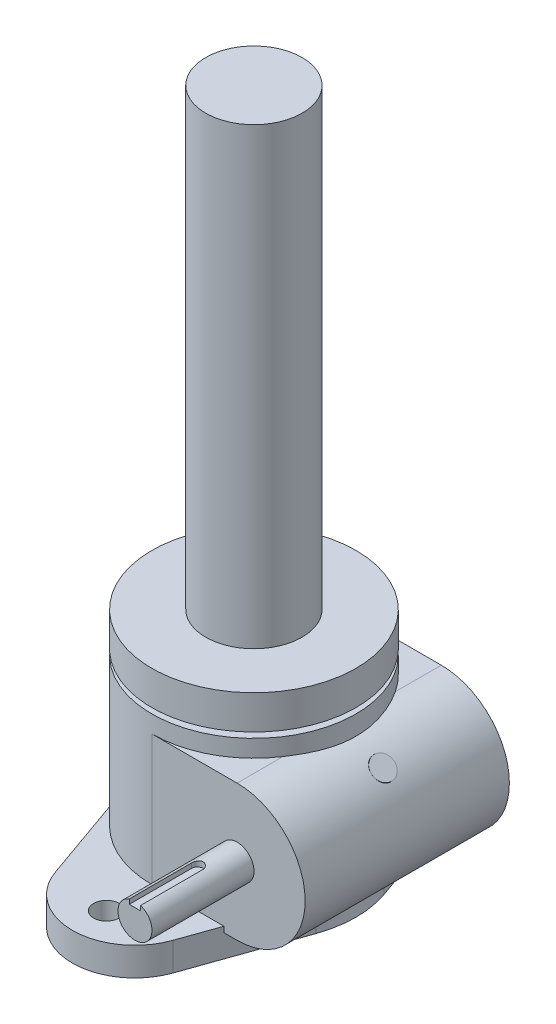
ISO-10303-21;
HEADER;
FILE_DESCRIPTION(('STEP AP214'),'2;1');
FILE_NAME('part.step','',(''),(''),'','','');
FILE_SCHEMA(('AUTOMOTIVE_DESIGN { 1 0 10303 214 1 1 1 1 }'));
ENDSEC;
DATA;
#1=APPLICATION_CONTEXT('core data for automotive mechanical design processes');
#2=APPLICATION_PROTOCOL_DEFINITION('international standard','automotive_design',2000,#1);
#3=PRODUCT_CONTEXT('',#1,'mechanical');
#4=PRODUCT('Part','Part','',(#3));
#5=PRODUCT_RELATED_PRODUCT_CATEGORY('part','',(#4));
#6=PRODUCT_DEFINITION_FORMATION('','',#4);
#7=PRODUCT_DEFINITION_CONTEXT('part definition',#1,'design');
#8=PRODUCT_DEFINITION('design','',#6,#7);
#9=PRODUCT_DEFINITION_SHAPE('','',#8);
#10=(LENGTH_UNIT() NAMED_UNIT(*) SI_UNIT(.MILLI.,.METRE.));
#11=(NAMED_UNIT(*) PLANE_ANGLE_UNIT() SI_UNIT($,.RADIAN.));
#12=(NAMED_UNIT(*) SI_UNIT($,.STERADIAN.) SOLID_ANGLE_UNIT());
#13=UNCERTAINTY_MEASURE_WITH_UNIT(LENGTH_MEASURE(1.E-05),#10,'distance_accuracy_value','');
#14=(GEOMETRIC_REPRESENTATION_CONTEXT(3) GLOBAL_UNCERTAINTY_ASSIGNED_CONTEXT((#13)) GLOBAL_UNIT_ASSIGNED_CONTEXT((#10,
#11,#12)) REPRESENTATION_CONTEXT('',''));
#15=CARTESIAN_POINT('',(0.,0.,0.));
#16=DIRECTION('',(0.,0.,1.));
#17=DIRECTION('',(1.,0.,0.));
#18=AXIS2_PLACEMENT_3D('',#15,#16,#17);
#19=CARTESIAN_POINT('',(23.8633,20.6502,57.15));
#20=DIRECTION('',(0.,0.,1.));
#21=DIRECTION('',(1.,0.,0.));
#22=AXIS2_PLACEMENT_3D('',#19,#20,#21);
#23=PLANE('',#22);
#24=DIRECTION('',(1.,0.,0.));
#25=VECTOR('',#24,1.);
#26=CARTESIAN_POINT('',(22.2758,28.5623,57.15));
#27=LINE('',#26,#25);
#28=CARTESIAN_POINT('',(22.2758,28.5623,57.15));
#29=VERTEX_POINT('',#28);
#30=CARTESIAN_POINT('',(25.4508,28.5623,57.15));
#31=VERTEX_POINT('',#30);
#32=EDGE_CURVE('E220',#29,#31,#27,.T.);
#33=ORIENTED_EDGE('',*,*,#32,.F.);
#34=DIRECTION('',(0.,-1.,0.));
#35=VECTOR('',#34,1.);
#36=CARTESIAN_POINT('',(22.2758,73.2750710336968,57.15));
#37=LINE('',#36,#35);
#38=CARTESIAN_POINT('',(22.2758,29.8766554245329,57.15));
#39=VERTEX_POINT('',#38);
#40=EDGE_CURVE('E218',#39,#29,#37,.T.);
#41=ORIENTED_EDGE('',*,*,#40,.F.);
#42=CARTESIAN_POINT('',(23.8633,25.4,57.15));
#43=DIRECTION('',(0.,0.,-1.));
#44=DIRECTION('',(-1.,0.,0.));
#45=AXIS2_PLACEMENT_3D('',#42,#43,#44);
#46=CIRCLE('',#45,4.74980000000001);
#47=CARTESIAN_POINT('',(25.4508,29.8766554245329,57.15));
#48=VERTEX_POINT('',#47);
#49=EDGE_CURVE('E356',#48,#39,#46,.T.);
#50=ORIENTED_EDGE('',*,*,#49,.F.);
#51=DIRECTION('',(0.,-1.,0.));
#52=VECTOR('',#51,1.);
#53=CARTESIAN_POINT('',(25.4508,73.2750710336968,57.15));
#54=LINE('',#53,#52);
#55=EDGE_CURVE('E225',#48,#31,#54,.T.);
#56=ORIENTED_EDGE('',*,*,#55,.T.);
#57=EDGE_LOOP('',(#33,#41,#50,#56));
#58=FACE_BOUND('',#57,.T.);
#59=ADVANCED_FACE('F31',(#58),#23,.T.);
#60=CARTESIAN_POINT('',(23.8633,25.4,-105.895333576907));
#61=DIRECTION('',(0.,0.,-1.));
#62=DIRECTION('',(-1.,0.,0.));
#63=AXIS2_PLACEMENT_3D('',#60,#61,#62);
#64=CYLINDRICAL_SURFACE('',#63,4.74980000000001);
#65=CARTESIAN_POINT('',(23.8633,25.4,28.575));
#66=DIRECTION('',(0.,0.,1.));
#67=DIRECTION('',(1.,0.,0.));
#68=AXIS2_PLACEMENT_3D('',#65,#66,#67);
#69=CIRCLE('',#68,4.74980000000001);
#70=CARTESIAN_POINT('',(28.6131,25.4,28.575));
#71=VERTEX_POINT('',#70);
#72=EDGE_CURVE('E360',#71,#71,#69,.T.);
#73=ORIENTED_EDGE('',*,*,#72,.T.);
#74=EDGE_LOOP('',(#73));
#75=FACE_BOUND('',#74,.T.);
#76=ORIENTED_EDGE('',*,*,#49,.T.);
#77=DIRECTION('',(0.,0.,-1.));
#78=VECTOR('',#77,1.);
#79=CARTESIAN_POINT('',(22.2758,29.8766554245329,-105.895333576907));
#80=LINE('',#79,#78);
#81=CARTESIAN_POINT('',(22.2758,29.8766554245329,39.6875));
#82=VERTEX_POINT('',#81);
#83=EDGE_CURVE('E11',#39,#82,#80,.T.);
#84=ORIENTED_EDGE('',*,*,#83,.T.);
#85=CARTESIAN_POINT('',(22.2758,29.8766554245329,39.6875));
#86=CARTESIAN_POINT('',(22.2757988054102,29.876651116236,39.6441836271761));
#87=CARTESIAN_POINT('',(22.2775740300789,29.8772849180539,39.6008893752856));
#88=CARTESIAN_POINT('',(22.2846463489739,29.8797850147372,39.5146368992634));
#89=CARTESIAN_POINT('',(22.2899424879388,29.881650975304,39.4716785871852));
#90=CARTESIAN_POINT('',(22.3110132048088,29.8890131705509,39.3440373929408));
#91=CARTESIAN_POINT('',(22.3319706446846,29.8962743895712,39.2602512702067));
#92=CARTESIAN_POINT('',(22.386949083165,29.9146223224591,39.0976526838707));
#93=CARTESIAN_POINT('',(22.4209627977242,29.9257069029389,39.0188374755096));
#94=CARTESIAN_POINT('',(22.5010183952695,29.9504439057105,38.867962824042));
#95=CARTESIAN_POINT('',(22.5470677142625,29.9640979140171,38.7959075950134));
#96=CARTESIAN_POINT('',(22.6518089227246,29.9930314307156,38.6578301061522));
#97=CARTESIAN_POINT('',(22.7108915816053,30.0083514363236,38.5921128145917));
#98=CARTESIAN_POINT('',(22.8391912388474,30.0385492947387,38.4713080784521));
#99=CARTESIAN_POINT('',(22.9084100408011,30.0534270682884,38.4162225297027));
#100=CARTESIAN_POINT('',(23.0572607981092,30.081535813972,38.3168541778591));
#101=CARTESIAN_POINT('',(23.1371184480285,30.0947132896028,38.2728929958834));
#102=CARTESIAN_POINT('',(23.3036082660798,30.1174559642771,38.1991507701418));
#103=CARTESIAN_POINT('',(23.390238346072,30.1270222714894,38.1693653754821));
#104=CARTESIAN_POINT('',(23.5646025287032,30.1411770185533,38.1258581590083));
#105=CARTESIAN_POINT('',(23.6521921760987,30.1459277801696,38.111611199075));
#106=CARTESIAN_POINT('',(23.8286407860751,30.1504925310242,38.0979151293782));
#107=CARTESIAN_POINT('',(23.9174994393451,30.1503077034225,38.0984624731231));
#108=CARTESIAN_POINT('',(24.0902426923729,30.1451317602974,38.1140075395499));
#109=CARTESIAN_POINT('',(24.1741852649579,30.1403304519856,38.1284346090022));
#110=CARTESIAN_POINT('',(24.3383799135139,30.1266996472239,38.1703853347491));
#111=CARTESIAN_POINT('',(24.4186317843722,30.1178699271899,38.1979097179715));
#112=CARTESIAN_POINT('',(24.5744134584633,30.0969331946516,38.2656056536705));
#113=CARTESIAN_POINT('',(24.6498670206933,30.0847844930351,38.3059392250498));
#114=CARTESIAN_POINT('',(24.793102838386,30.0584737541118,38.3979749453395));
#115=CARTESIAN_POINT('',(24.8608829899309,30.0443111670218,38.4496802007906));
#116=CARTESIAN_POINT('',(24.9902364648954,30.0146751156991,38.5658583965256));
#117=CARTESIAN_POINT('',(25.0513654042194,29.9991713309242,38.6308190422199));
#118=CARTESIAN_POINT('',(25.1620167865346,29.9691608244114,38.7702155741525));
#119=CARTESIAN_POINT('',(25.2115354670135,29.9546544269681,38.8446545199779));
#120=CARTESIAN_POINT('',(25.2981888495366,29.9281105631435,39.0023252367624));
#121=CARTESIAN_POINT('',(25.3351279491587,29.9161131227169,39.0856715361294));
#122=CARTESIAN_POINT('',(25.3942538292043,29.8964171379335,39.2578602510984));
#123=CARTESIAN_POINT('',(25.4164639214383,29.8887118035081,39.3466937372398));
#124=CARTESIAN_POINT('',(25.4375103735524,29.8813505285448,39.4782462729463));
#125=CARTESIAN_POINT('',(25.4424918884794,29.8795948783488,39.5199473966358));
#126=CARTESIAN_POINT('',(25.4491345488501,29.8772465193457,39.6035915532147));
#127=CARTESIAN_POINT('',(25.4507999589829,29.8766523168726,39.6455342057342));
#128=CARTESIAN_POINT('',(25.4508,29.8766554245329,39.6875));
#129=B_SPLINE_CURVE_WITH_KNOTS('',3,(#85,#86,#87,#88,#89,#90,#91,#92,#93,#94,#95,#96,#97,#98,
#99,#100,#101,#102,#103,#104,#105,#106,#107,#108,#109,#110,#111,#112,#113,#114,#115,#116,#117,
#118,#119,#120,#121,#122,#123,#124,#125,#126,#127,#128),.UNSPECIFIED.,.F.,.F.,(4,2,2,2,2,2,2,2,
2,2,2,2,2,2,2,2,2,2,2,2,2,4),(0.,0.129864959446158,0.259694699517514,0.518356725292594,
0.77687465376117,1.03555268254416,1.30341355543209,1.57132214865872,1.84626513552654,
2.12112368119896,2.3863739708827,2.65156067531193,2.90629063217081,3.16103472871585,
3.41913871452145,3.67731329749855,3.94768229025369,4.21813878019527,4.49262677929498,
4.76667929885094,4.89265618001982,5.01847094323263),.UNSPECIFIED.);
#130=CARTESIAN_POINT('',(25.4508,29.8766554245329,39.6875));
#131=VERTEX_POINT('',#130);
#132=EDGE_CURVE('E202',#82,#131,#129,.T.);
#133=ORIENTED_EDGE('',*,*,#132,.T.);
#134=DIRECTION('',(0.,0.,-1.));
#135=VECTOR('',#134,1.);
#136=CARTESIAN_POINT('',(25.4508,29.8766554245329,-105.895333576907));
#137=LINE('',#136,#135);
#138=EDGE_CURVE('E39',#131,#48,#137,.F.);
#139=ORIENTED_EDGE('',*,*,#138,.T.);
#140=EDGE_LOOP('',(#76,#84,#133,#139));
#141=FACE_BOUND('',#140,.T.);
#142=ADVANCED_FACE('F550',(#75,#141),#64,.T.);
#143=CARTESIAN_POINT('',(0.,-9.525,0.));
#144=DIRECTION('',(0.,1.,0.));
#145=DIRECTION('',(0.,0.,1.));
#146=AXIS2_PLACEMENT_3D('',#143,#144,#145);
#147=PLANE('',#146);
#148=CARTESIAN_POINT('',(0.,-9.525,0.));
#149=DIRECTION('',(0.,-1.,0.));
#150=DIRECTION('',(0.,0.,-1.));
#151=AXIS2_PLACEMENT_3D('',#148,#149,#150);
#152=CIRCLE('',#151,14.2875);
#153=CARTESIAN_POINT('',(0.,-9.525,-14.2875));
#154=VERTEX_POINT('',#153);
#155=EDGE_CURVE('E422',#154,#154,#152,.T.);
#156=ORIENTED_EDGE('',*,*,#155,.T.);
#157=EDGE_LOOP('',(#156));
#158=FACE_BOUND('',#157,.T.);
#159=CARTESIAN_POINT('',(0.,-9.525,0.));
#160=DIRECTION('',(0.,1.,0.));
#161=DIRECTION('',(0.,0.,1.));
#162=AXIS2_PLACEMENT_3D('',#159,#160,#161);
#163=CIRCLE('',#162,7.9375);
#164=CARTESIAN_POINT('',(0.,-9.525,7.9375));
#165=VERTEX_POINT('',#164);
#166=EDGE_CURVE('E239',#165,#165,#163,.F.);
#167=ORIENTED_EDGE('',*,*,#166,.F.);
#168=EDGE_LOOP('',(#167));
#169=FACE_BOUND('',#168,.T.);
#170=ADVANCED_FACE('F33',(#158,#169),#147,.F.);
#171=CARTESIAN_POINT('',(0.,0.,0.));
#172=DIRECTION('',(0.,-1.,0.));
#173=DIRECTION('',(0.,0.,-1.));
#174=AXIS2_PLACEMENT_3D('',#171,#172,#173);
#175=CYLINDRICAL_SURFACE('',#174,28.575);
#176=DIRECTION('',(0.,-1.,0.));
#177=VECTOR('',#176,1.);
#178=CARTESIAN_POINT('',(26.9407683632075,124.508004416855,-9.52500000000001));
#179=LINE('',#178,#177);
#180=CARTESIAN_POINT('',(26.9407683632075,6.60022105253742,-9.52500000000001));
#181=VERTEX_POINT('',#180);
#182=CARTESIAN_POINT('',(26.9407683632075,0.,-9.52500000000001));
#183=VERTEX_POINT('',#182);
#184=EDGE_CURVE('E296',#181,#183,#179,.T.);
#185=ORIENTED_EDGE('',*,*,#184,.F.);
#186=CARTESIAN_POINT('',(4.8133,25.4,28.1666960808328));
#187=CARTESIAN_POINT('',(4.81329492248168,24.8789057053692,28.1666907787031));
#188=CARTESIAN_POINT('',(4.8346892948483,24.3578908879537,28.1630643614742));
#189=CARTESIAN_POINT('',(4.9201037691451,23.3193094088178,28.1482711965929));
#190=CARTESIAN_POINT('',(4.984133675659,22.8017435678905,28.1371027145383));
#191=CARTESIAN_POINT('',(5.15443649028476,21.7733055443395,28.1064026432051));
#192=CARTESIAN_POINT('',(5.26075386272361,21.2624409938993,28.0868622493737));
#193=CARTESIAN_POINT('',(5.51478361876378,20.2516030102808,28.0380902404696));
#194=CARTESIAN_POINT('',(5.66249358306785,19.75162894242,28.008859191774));
#195=CARTESIAN_POINT('',(5.99823795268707,18.7657356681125,27.9388828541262));
#196=CARTESIAN_POINT('',(6.18630750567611,18.2798291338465,27.898127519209));
#197=CARTESIAN_POINT('',(6.60103950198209,17.3261391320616,27.8029160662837));
#198=CARTESIAN_POINT('',(6.82770262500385,16.8583559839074,27.7484597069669));
#199=CARTESIAN_POINT('',(7.31734659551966,15.9447151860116,27.6233750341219));
#200=CARTESIAN_POINT('',(7.58031105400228,15.4988477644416,27.5527540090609));
#201=CARTESIAN_POINT('',(8.13989262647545,14.6323207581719,27.3926524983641));
#202=CARTESIAN_POINT('',(8.43650849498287,14.2116602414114,27.3031727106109));
#203=CARTESIAN_POINT('',(9.05198817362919,13.4093130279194,27.1052370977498));
#204=CARTESIAN_POINT('',(9.37008384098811,13.026902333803,26.9973283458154));
#205=CARTESIAN_POINT('',(10.0312516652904,12.291940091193,26.7587009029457));
#206=CARTESIAN_POINT('',(10.374323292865,11.9393879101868,26.6279826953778));
#207=CARTESIAN_POINT('',(11.0809293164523,11.2666579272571,26.3417693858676));
#208=CARTESIAN_POINT('',(11.4444542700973,10.9464653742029,26.1862856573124));
#209=CARTESIAN_POINT('',(12.1872449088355,10.3400503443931,25.8489456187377));
#210=CARTESIAN_POINT('',(12.5665099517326,10.053826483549,25.667090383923));
#211=CARTESIAN_POINT('',(13.3155302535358,9.53037947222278,25.2862510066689));
#212=CARTESIAN_POINT('',(13.6847517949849,9.29138050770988,25.0886525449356));
#213=CARTESIAN_POINT('',(14.4281232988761,8.84500372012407,24.6686459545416));
#214=CARTESIAN_POINT('',(14.8022730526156,8.63762456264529,24.44623887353));
#215=CARTESIAN_POINT('',(15.551091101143,8.25395942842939,23.9768525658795));
#216=CARTESIAN_POINT('',(15.9257594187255,8.07767486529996,23.7298722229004));
#217=CARTESIAN_POINT('',(16.6714526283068,7.75503155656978,23.2120521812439));
#218=CARTESIAN_POINT('',(17.0424773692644,7.60867404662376,22.94121149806));
#219=CARTESIAN_POINT('',(17.787849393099,7.3402971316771,22.3685117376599));
#220=CARTESIAN_POINT('',(18.1619778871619,7.21911221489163,22.0659783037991));
#221=CARTESIAN_POINT('',(18.8988618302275,7.00423460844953,21.4382359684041));
#222=CARTESIAN_POINT('',(19.2616173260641,6.91054180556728,21.1130271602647));
#223=CARTESIAN_POINT('',(19.9730143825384,6.74788479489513,20.4413489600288));
#224=CARTESIAN_POINT('',(20.3216485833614,6.67893333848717,20.0948687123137));
#225=CARTESIAN_POINT('',(21.0022793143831,6.56290123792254,19.3824093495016));
#226=CARTESIAN_POINT('',(21.3342723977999,6.51582510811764,19.016426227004));
#227=CARTESIAN_POINT('',(22.128305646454,6.42323832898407,18.0939283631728));
#228=CARTESIAN_POINT('',(22.5798613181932,6.38842354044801,17.5272581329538));
#229=CARTESIAN_POINT('',(23.4390778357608,6.34986479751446,16.3604939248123));
#230=CARTESIAN_POINT('',(23.8467220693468,6.34613256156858,15.7603874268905));
#231=CARTESIAN_POINT('',(24.6156511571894,6.36097258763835,14.5302197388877));
#232=CARTESIAN_POINT('',(24.9768633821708,6.37957933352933,13.9001136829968));
#233=CARTESIAN_POINT('',(25.6500227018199,6.43097028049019,12.6148048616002));
#234=CARTESIAN_POINT('',(25.9619738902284,6.4637533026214,11.9596041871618));
#235=CARTESIAN_POINT('',(26.5397982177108,6.53667321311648,10.6166348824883));
#236=CARTESIAN_POINT('',(26.804819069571,6.57692330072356,9.92850589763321));
#237=CARTESIAN_POINT('',(27.2808965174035,6.65751202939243,8.5338306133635));
#238=CARTESIAN_POINT('',(27.4919526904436,6.69785067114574,7.82728416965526));
#239=CARTESIAN_POINT('',(27.8587317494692,6.77275961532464,6.40030285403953));
#240=CARTESIAN_POINT('',(28.01450212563,6.80733485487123,5.67988046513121));
#241=CARTESIAN_POINT('',(28.2699726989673,6.86622202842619,4.22872154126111));
#242=CARTESIAN_POINT('',(28.3696712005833,6.89053365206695,3.49798469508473));
#243=CARTESIAN_POINT('',(28.5184641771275,6.92735797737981,1.96705034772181));
#244=CARTESIAN_POINT('',(28.5624277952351,6.93866636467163,1.16631847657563));
#245=CARTESIAN_POINT('',(28.5829069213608,6.94389282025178,-0.436099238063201));
#246=CARTESIAN_POINT('',(28.5594182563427,6.9378098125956,-1.23778513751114));
#247=CARTESIAN_POINT('',(28.4451580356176,6.90912325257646,-2.83662060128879));
#248=CARTESIAN_POINT('',(28.354337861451,6.88650776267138,-3.6337664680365));
#249=CARTESIAN_POINT('',(28.106132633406,6.82805700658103,-5.21709628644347));
#250=CARTESIAN_POINT('',(27.9487488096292,6.79222198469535,-6.00328044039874));
#251=CARTESIAN_POINT('',(27.5727344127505,6.71367905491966,-7.5424825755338));
#252=CARTESIAN_POINT('',(27.3554968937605,6.67113591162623,-8.29585018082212));
#253=CARTESIAN_POINT('',(26.8598700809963,6.5854771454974,-9.78221619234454));
#254=CARTESIAN_POINT('',(26.5814772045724,6.54236148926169,-10.5152134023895));
#255=CARTESIAN_POINT('',(25.9653064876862,6.46377883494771,-11.956057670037));
#256=CARTESIAN_POINT('',(25.6275417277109,6.42831015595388,-12.6639102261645));
#257=CARTESIAN_POINT('',(24.8946713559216,6.37439326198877,-14.0499155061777));
#258=CARTESIAN_POINT('',(24.4995777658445,6.35594148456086,-14.7280744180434));
#259=CARTESIAN_POINT('',(23.7356306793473,6.34736729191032,-15.9233460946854));
#260=CARTESIAN_POINT('',(23.3762002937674,6.35250343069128,-16.4464618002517));
#261=CARTESIAN_POINT('',(22.6236758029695,6.38664496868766,-17.4671622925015));
#262=CARTESIAN_POINT('',(22.2305835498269,6.4156490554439,-17.964748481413));
#263=CARTESIAN_POINT('',(21.4141423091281,6.5036394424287,-18.9305141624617));
#264=CARTESIAN_POINT('',(20.9908375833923,6.56258262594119,-19.3987348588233));
#265=CARTESIAN_POINT('',(20.1173772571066,6.71666341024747,-20.3031186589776));
#266=CARTESIAN_POINT('',(19.6672270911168,6.81179370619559,-20.7392882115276));
#267=CARTESIAN_POINT('',(18.8305740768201,7.02272257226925,-21.4987864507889));
#268=CARTESIAN_POINT('',(18.4476853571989,7.13145118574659,-21.8280710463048));
#269=CARTESIAN_POINT('',(17.6711499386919,7.37984811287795,-22.4613434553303));
#270=CARTESIAN_POINT('',(17.27750443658,7.51951299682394,-22.7653340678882));
#271=CARTESIAN_POINT('',(16.4838637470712,7.83218238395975,-23.3464054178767));
#272=CARTESIAN_POINT('',(16.0838712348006,8.00517316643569,-23.6234971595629));
#273=CARTESIAN_POINT('',(15.2822497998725,8.38632892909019,-24.1498107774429));
#274=CARTESIAN_POINT('',(14.880620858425,8.59449431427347,-24.399032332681));
#275=CARTESIAN_POINT('',(14.0792826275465,9.04798608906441,-24.870090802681));
#276=CARTESIAN_POINT('',(13.6795898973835,9.29347413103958,-25.0918005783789));
#277=CARTESIAN_POINT('',(12.8895712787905,9.820996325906,-25.5066398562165));
#278=CARTESIAN_POINT('',(12.4992454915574,10.1030308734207,-25.6997690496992));
#279=CARTESIAN_POINT('',(11.7335035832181,10.7028202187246,-26.0582870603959));
#280=CARTESIAN_POINT('',(11.3580892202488,11.0205792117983,-26.2236726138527));
#281=CARTESIAN_POINT('',(10.6274951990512,11.690096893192,-26.5281669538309));
#282=CARTESIAN_POINT('',(10.2723146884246,12.0418541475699,-26.6672768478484));
#283=CARTESIAN_POINT('',(9.6120626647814,12.7500320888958,-26.9119611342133));
#284=CARTESIAN_POINT('',(9.30522645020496,13.1042226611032,-27.0192458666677));
#285=CARTESIAN_POINT('',(8.71630061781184,13.8374739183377,-27.2149413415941));
#286=CARTESIAN_POINT('',(8.43420960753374,14.2165332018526,-27.3033531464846));
#287=CARTESIAN_POINT('',(7.89754368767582,14.9970451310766,-27.4633916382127));
#288=CARTESIAN_POINT('',(7.64297130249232,15.3984998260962,-27.5350167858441));
#289=CARTESIAN_POINT('',(7.16368865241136,16.2211053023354,-27.6635821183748));
#290=CARTESIAN_POINT('',(6.93897961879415,16.6422568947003,-27.720521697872));
#291=CARTESIAN_POINT('',(6.51442857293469,17.5156707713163,-27.8234101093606));
#292=CARTESIAN_POINT('',(6.31565212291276,17.9685010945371,-27.8689341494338));
#293=CARTESIAN_POINT('',(5.953647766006,18.8891221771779,-27.9485073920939));
#294=CARTESIAN_POINT('',(5.79042035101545,19.3569131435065,-27.9825564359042));
#295=CARTESIAN_POINT('',(5.500755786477,20.304420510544,-28.0409372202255));
#296=CARTESIAN_POINT('',(5.37432467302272,20.7841388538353,-28.0652673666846));
#297=CARTESIAN_POINT('',(5.15921478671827,21.7523118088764,-28.1056062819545));
#298=CARTESIAN_POINT('',(5.07053701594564,22.2407666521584,-28.1216148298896));
#299=CARTESIAN_POINT('',(4.92822160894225,23.246931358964,-28.1469140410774));
#300=CARTESIAN_POINT('',(4.87647398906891,23.7649185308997,-28.155844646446));
#301=CARTESIAN_POINT('',(4.81553748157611,24.8034732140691,-28.16633050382));
#302=CARTESIAN_POINT('',(4.80634997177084,25.3240408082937,-28.1678855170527));
#303=CARTESIAN_POINT('',(4.83060634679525,26.3642408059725,-28.1637359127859));
#304=CARTESIAN_POINT('',(4.86405719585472,26.8838730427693,-28.1580301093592));
#305=CARTESIAN_POINT('',(4.97335091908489,27.9185185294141,-28.1389316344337));
#306=CARTESIAN_POINT('',(5.04919383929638,28.4335317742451,-28.1255389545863));
#307=CARTESIAN_POINT('',(5.2440457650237,29.4624940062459,-28.089865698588));
#308=CARTESIAN_POINT('',(5.36364323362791,29.9763275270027,-28.0674635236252));
#309=CARTESIAN_POINT('',(5.64485529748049,30.991810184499,-28.0122606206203));
#310=CARTESIAN_POINT('',(5.8064705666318,31.4934591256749,-27.9794597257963));
#311=CARTESIAN_POINT('',(6.17032462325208,32.4808133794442,-27.9014750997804));
#312=CARTESIAN_POINT('',(6.37256274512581,32.9665189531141,-27.8562915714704));
#313=CARTESIAN_POINT('',(6.81579839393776,33.9182582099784,-27.7511686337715));
#314=CARTESIAN_POINT('',(7.0567950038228,34.3842923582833,-27.6912295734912));
#315=CARTESIAN_POINT('',(7.57076937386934,35.2853636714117,-27.5550995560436));
#316=CARTESIAN_POINT('',(7.84314044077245,35.7207905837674,-27.479199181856));
#317=CARTESIAN_POINT('',(8.42013308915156,36.5656955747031,-27.3079200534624));
#318=CARTESIAN_POINT('',(8.72475431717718,36.9751739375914,-27.2125415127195));
#319=CARTESIAN_POINT('',(9.36254098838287,37.7647846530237,-26.9997472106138));
#320=CARTESIAN_POINT('',(9.6956906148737,38.1449330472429,-26.882343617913));
#321=CARTESIAN_POINT('',(10.3864769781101,38.8732926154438,-26.6230677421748));
#322=CARTESIAN_POINT('',(10.7441123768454,39.2215055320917,-26.4811967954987));
#323=CARTESIAN_POINT('',(11.4598096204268,39.8663641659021,-26.1791183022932));
#324=CARTESIAN_POINT('',(11.8168699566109,40.1647547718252,-26.0202586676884));
#325=CARTESIAN_POINT('',(12.5441356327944,40.7294140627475,-25.6775546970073));
#326=CARTESIAN_POINT('',(12.9143403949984,40.9956841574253,-25.4937114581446));
#327=CARTESIAN_POINT('',(13.6630743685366,41.4953550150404,-25.1003941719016));
#328=CARTESIAN_POINT('',(14.041601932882,41.7287622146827,-24.8909251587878));
#329=CARTESIAN_POINT('',(14.80226655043,42.1628145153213,-24.4462185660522));
#330=CARTESIAN_POINT('',(15.1844036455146,42.3634592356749,-24.2109806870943));
#331=CARTESIAN_POINT('',(15.9405368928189,42.7293237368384,-23.7198094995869));
#332=CARTESIAN_POINT('',(16.3145519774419,42.895134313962,-23.4643438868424));
#333=CARTESIAN_POINT('',(17.0575562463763,43.1973374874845,-22.9298895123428));
#334=CARTESIAN_POINT('',(17.4265456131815,43.3337311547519,-22.650901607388));
#335=CARTESIAN_POINT('',(18.1560895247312,43.5790659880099,-22.0704420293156));
#336=CARTESIAN_POINT('',(18.516640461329,43.6879955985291,-21.7689609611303));
#337=CARTESIAN_POINT('',(19.226132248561,43.8806485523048,-21.1449716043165));
#338=CARTESIAN_POINT('',(19.5750707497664,43.9643668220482,-20.8224590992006));
#339=CARTESIAN_POINT('',(20.3877570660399,44.1364536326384,-20.0324920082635));
#340=CARTESIAN_POINT('',(20.8451596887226,44.2146631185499,-19.5562551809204));
#341=CARTESIAN_POINT('',(21.72787957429,44.335182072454,-18.5706228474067));
#342=CARTESIAN_POINT('',(22.1531862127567,44.3774796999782,-18.0612164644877));
#343=CARTESIAN_POINT('',(22.9684988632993,44.4333663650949,-17.0123638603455));
#344=CARTESIAN_POINT('',(23.3584549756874,44.4469154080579,-16.472876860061));
#345=CARTESIAN_POINT('',(24.0997319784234,44.4521391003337,-15.3680243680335));
#346=CARTESIAN_POINT('',(24.4510551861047,44.443815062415,-14.8026604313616));
#347=CARTESIAN_POINT('',(25.1192901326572,44.4115477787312,-13.6385687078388));
#348=CARTESIAN_POINT('',(25.435451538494,44.3873205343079,-13.0394189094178));
#349=CARTESIAN_POINT('',(26.0242651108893,44.329349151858,-11.820590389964));
#350=CARTESIAN_POINT('',(26.2969172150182,44.2956050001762,-11.2009116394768));
#351=CARTESIAN_POINT('',(26.797438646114,44.2243790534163,-9.94410847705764));
#352=CARTESIAN_POINT('',(27.0253186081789,44.1868981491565,-9.3069882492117));
#353=CARTESIAN_POINT('',(27.4353490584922,44.1132662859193,-8.01808541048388));
#354=CARTESIAN_POINT('',(27.6174956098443,44.0771154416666,-7.36630154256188));
#355=CARTESIAN_POINT('',(27.9639000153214,44.0044232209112,-5.93204044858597));
#356=CARTESIAN_POINT('',(28.1189518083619,43.9689956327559,-5.14726195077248));
#357=CARTESIAN_POINT('',(28.362774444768,43.9114272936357,-3.56692759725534));
#358=CARTESIAN_POINT('',(28.4515393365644,43.8892877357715,-2.77137078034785));
#359=CARTESIAN_POINT('',(28.5620161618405,43.8615235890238,-1.17539871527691));
#360=CARTESIAN_POINT('',(28.5837359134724,43.8558970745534,-0.374984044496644));
#361=CARTESIAN_POINT('',(28.5599461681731,43.8619653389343,1.22474763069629));
#362=CARTESIAN_POINT('',(28.5144392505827,43.8736594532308,2.0240646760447));
#363=CARTESIAN_POINT('',(28.3581669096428,43.9122916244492,3.59993884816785));
#364=CARTESIAN_POINT('',(28.2487078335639,43.9389241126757,4.37663373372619));
#365=CARTESIAN_POINT('',(27.9664514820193,44.0034285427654,5.91794557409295));
#366=CARTESIAN_POINT('',(27.7936531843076,44.0413006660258,6.68256233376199));
#367=CARTESIAN_POINT('',(27.3856668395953,44.1226788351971,8.1957824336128));
#368=CARTESIAN_POINT('',(27.1503924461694,44.1661926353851,8.94436204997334));
#369=CARTESIAN_POINT('',(26.6190580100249,44.2515419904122,10.4197464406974));
#370=CARTESIAN_POINT('',(26.3229973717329,44.2933775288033,11.1465510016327));
#371=CARTESIAN_POINT('',(25.6638404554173,44.3676900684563,12.5914264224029));
#372=CARTESIAN_POINT('',(25.299269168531,44.3999104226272,13.3088382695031));
#373=CARTESIAN_POINT('',(24.5104027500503,44.4431022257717,14.7111382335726));
#374=CARTESIAN_POINT('',(24.0860985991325,44.4540704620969,15.3960214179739));
#375=CARTESIAN_POINT('',(23.4081460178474,44.445897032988,16.3936197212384));
#376=CARTESIAN_POINT('',(23.1754983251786,44.4390872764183,16.7208865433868));
#377=CARTESIAN_POINT('',(22.6967877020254,44.4157615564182,17.3651204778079));
#378=CARTESIAN_POINT('',(22.4507255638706,44.3992461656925,17.68208819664));
#379=CARTESIAN_POINT('',(21.946022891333,44.3549642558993,18.3047319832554));
#380=CARTESIAN_POINT('',(21.6873899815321,44.3272044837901,18.610414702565));
#381=CARTESIAN_POINT('',(21.1582053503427,44.2588484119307,19.2099166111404));
#382=CARTESIAN_POINT('',(20.8876509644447,44.2182492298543,19.5037331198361));
#383=CARTESIAN_POINT('',(20.2424044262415,44.1064697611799,20.1757208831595));
#384=CARTESIAN_POINT('',(19.8634082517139,44.0295918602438,20.5488585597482));
#385=CARTESIAN_POINT('',(19.0891674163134,43.8463639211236,21.2700289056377));
#386=CARTESIAN_POINT('',(18.6939274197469,43.7400222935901,21.6180687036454));
#387=CARTESIAN_POINT('',(17.8911951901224,43.4945420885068,22.2869572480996));
#388=CARTESIAN_POINT('',(17.4837111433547,43.3554250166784,22.607823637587));
#389=CARTESIAN_POINT('',(16.6608975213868,43.0414780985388,23.2208595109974));
#390=CARTESIAN_POINT('',(16.2455677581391,42.8666473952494,23.5130283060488));
#391=CARTESIAN_POINT('',(15.4096732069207,42.4778373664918,24.0691976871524));
#392=CARTESIAN_POINT('',(14.9890919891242,42.2636035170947,24.3329963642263));
#393=CARTESIAN_POINT('',(14.1515366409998,41.7955556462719,24.8294513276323));
#394=CARTESIAN_POINT('',(13.7345625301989,41.5417414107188,25.0621074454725));
#395=CARTESIAN_POINT('',(12.9106475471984,40.9944366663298,25.4963268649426));
#396=CARTESIAN_POINT('',(12.5037054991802,40.7009508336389,25.6978938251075));
#397=CARTESIAN_POINT('',(11.7061396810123,40.0752437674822,26.0708795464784));
#398=CARTESIAN_POINT('',(11.3155146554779,39.7430255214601,26.242300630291));
#399=CARTESIAN_POINT('',(10.5954195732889,39.0777556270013,26.5406057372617));
#400=CARTESIAN_POINT('',(10.2637837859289,38.7482748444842,26.6702531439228));
#401=CARTESIAN_POINT('',(9.62230659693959,38.0616468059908,26.9083424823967));
#402=CARTESIAN_POINT('',(9.31246359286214,37.7045015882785,27.0167859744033));
#403=CARTESIAN_POINT('',(8.71785842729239,36.9647479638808,27.2144779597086));
#404=CARTESIAN_POINT('',(8.43310419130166,36.5821315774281,27.3037204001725));
#405=CARTESIAN_POINT('',(7.89166001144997,35.7941217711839,27.4651080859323));
#406=CARTESIAN_POINT('',(7.63497070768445,35.388727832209,27.5372529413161));
#407=CARTESIAN_POINT('',(7.14958087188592,34.5536719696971,27.6672717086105));
#408=CARTESIAN_POINT('',(6.92119357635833,34.123804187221,27.7249920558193));
#409=CARTESIAN_POINT('',(6.49749150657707,33.2465601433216,27.8273381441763));
#410=CARTESIAN_POINT('',(6.30217836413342,32.7991830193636,27.8719632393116));
#411=CARTESIAN_POINT('',(5.94634635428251,31.8902436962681,27.9500408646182));
#412=CARTESIAN_POINT('',(5.78580139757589,31.4286924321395,27.9835017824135));
#413=CARTESIAN_POINT('',(5.50055919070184,30.4942096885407,28.0409622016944));
#414=CARTESIAN_POINT('',(5.37585577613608,30.0212801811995,28.0649633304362));
#415=CARTESIAN_POINT('',(5.11816154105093,28.8649632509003,28.1133286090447));
#416=CARTESIAN_POINT('',(5.0039560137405,28.1771296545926,28.1335563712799));
#417=CARTESIAN_POINT('',(4.85152643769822,26.7928170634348,28.1602440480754));
#418=CARTESIAN_POINT('',(4.81330678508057,26.0963375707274,28.1667031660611));
#419=CARTESIAN_POINT('',(4.8133,25.4,28.1666960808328));
#420=B_SPLINE_CURVE_WITH_KNOTS('',3,(#186,#187,#188,#189,#190,#191,#192,#193,#194,#195,#196,
#197,#198,#199,#200,#201,#202,#203,#204,#205,#206,#207,#208,#209,#210,#211,#212,#213,#214,#215,
#216,#217,#218,#219,#220,#221,#222,#223,#224,#225,#226,#227,#228,#229,#230,#231,#232,#233,#234,
#235,#236,#237,#238,#239,#240,#241,#242,#243,#244,#245,#246,#247,#248,#249,#250,#251,#252,#253,
#254,#255,#256,#257,#258,#259,#260,#261,#262,#263,#264,#265,#266,#267,#268,#269,#270,#271,#272,
#273,#274,#275,#276,#277,#278,#279,#280,#281,#282,#283,#284,#285,#286,#287,#288,#289,#290,#291,
#292,#293,#294,#295,#296,#297,#298,#299,#300,#301,#302,#303,#304,#305,#306,#307,#308,#309,#310,
#311,#312,#313,#314,#315,#316,#317,#318,#319,#320,#321,#322,#323,#324,#325,#326,#327,#328,#329,
#330,#331,#332,#333,#334,#335,#336,#337,#338,#339,#340,#341,#342,#343,#344,#345,#346,#347,#348,
#349,#350,#351,#352,#353,#354,#355,#356,#357,#358,#359,#360,#361,#362,#363,#364,#365,#366,#367,
#368,#369,#370,#371,#372,#373,#374,#375,#376,#377,#378,#379,#380,#381,#382,#383,#384,#385,#386,
#387,#388,#389,#390,#391,#392,#393,#394,#395,#396,#397,#398,#399,#400,#401,#402,#403,#404,#405,
#406,#407,#408,#409,#410,#411,#412,#413,#414,#415,#416,#417,#418,#419),.UNSPECIFIED.,.T.,.F.,(4,
2,2,2,2,2,2,2,2,2,2,2,2,2,2,2,2,2,2,2,2,2,2,2,2,2,2,2,2,2,2,2,2,2,2,2,2,2,2,2,2,2,2,2,2,2,2,2,2,
2,2,2,2,2,2,2,2,2,2,2,2,2,2,2,2,2,2,2,2,2,2,2,2,2,2,2,2,2,2,2,2,2,2,2,2,2,2,2,2,2,2,2,2,2,2,2,2,
2,2,2,2,2,2,2,2,2,2,2,2,2,2,2,2,2,2,2,4),(0.,1.56269393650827,3.12574735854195,4.69044865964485,
6.25505852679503,7.82103652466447,9.38704210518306,10.9523429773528,12.5175859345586,
14.0425829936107,15.5675477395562,17.0918141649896,18.6160184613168,20.060827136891,
21.5055748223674,22.9503881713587,24.3952611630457,25.8822816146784,27.3692959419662,
28.857075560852,30.345162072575,32.5182467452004,34.6921506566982,36.8694146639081,
39.0464976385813,41.259775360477,43.4730704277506,45.6844596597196,47.8959157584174,
50.2989117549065,52.7020564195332,55.1069380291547,57.5117751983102,59.8647846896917,
62.2179320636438,64.5705616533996,66.9226986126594,68.8251709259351,70.7275386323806,
72.6271743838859,74.5264268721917,76.0746409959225,77.6226835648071,79.1700901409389,
80.7175145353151,82.2718428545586,83.8261879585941,85.3807157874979,86.9351780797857,
88.3757444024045,89.8162296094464,91.2568468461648,92.6975234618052,94.185751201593,
95.6739995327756,97.1624918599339,98.6510236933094,100.211134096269,101.771295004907,
103.331710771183,104.892128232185,106.474353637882,108.056604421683,109.638829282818,
111.221016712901,112.776568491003,114.332103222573,115.886781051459,117.441373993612,
118.914621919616,120.387805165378,121.860699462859,123.33361087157,124.77905722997,
126.224450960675,127.670451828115,129.116743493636,131.108618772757,133.101150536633,
135.096452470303,137.091634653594,139.123453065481,141.155274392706,143.186612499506,
145.218125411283,147.617364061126,150.016818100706,152.41599232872,154.815074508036,
157.16678407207,159.518531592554,161.873546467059,164.22858441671,166.641785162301,
169.055350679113,170.259734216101,171.464046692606,172.66763761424,173.87149892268,
175.482040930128,177.092123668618,178.701152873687,180.310220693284,181.930072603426,
183.549933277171,185.16960318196,186.789148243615,188.242805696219,189.696356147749,
191.150364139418,192.604405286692,194.073323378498,195.542313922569,197.010198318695,
198.477830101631,200.565935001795,202.654160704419),.UNSPECIFIED.);
#421=CARTESIAN_POINT('',(26.9407683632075,6.60022105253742,9.525));
#422=VERTEX_POINT('',#421);
#423=EDGE_CURVE('E425',#422,#181,#420,.T.);
#424=ORIENTED_EDGE('',*,*,#423,.F.);
#425=DIRECTION('',(0.,-1.,0.));
#426=VECTOR('',#425,1.);
#427=CARTESIAN_POINT('',(26.9407683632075,124.508004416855,9.525));
#428=LINE('',#427,#426);
#429=CARTESIAN_POINT('',(26.9407683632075,0.,9.52500000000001));
#430=VERTEX_POINT('',#429);
#431=EDGE_CURVE('E298',#422,#430,#428,.T.);
#432=ORIENTED_EDGE('',*,*,#431,.T.);
#433=CARTESIAN_POINT('',(0.,0.,0.));
#434=DIRECTION('',(0.,-1.,0.));
#435=DIRECTION('',(0.,0.,-1.));
#436=AXIS2_PLACEMENT_3D('',#433,#434,#435);
#437=CIRCLE('',#436,28.575);
#438=EDGE_CURVE('E416',#183,#430,#437,.T.);
#439=ORIENTED_EDGE('',*,*,#438,.F.);
#440=EDGE_LOOP('',(#185,#424,#432,#439));
#441=FACE_BOUND('',#440,.T.);
#442=ADVANCED_FACE('F445',(#441),#175,.T.);
#443=CARTESIAN_POINT('',(23.8633,25.4,85.9610724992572));
#444=DIRECTION('',(0.,0.,-1.));
#445=DIRECTION('',(-1.,0.,0.));
#446=AXIS2_PLACEMENT_3D('',#443,#444,#445);
#447=CYLINDRICAL_SURFACE('',#446,19.05);
#448=CARTESIAN_POINT('',(38.3693264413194,37.7481859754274,0.));
#449=CARTESIAN_POINT('',(38.3693230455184,37.7481929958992,0.1770072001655));
#450=CARTESIAN_POINT('',(38.3595745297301,37.7596703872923,0.354111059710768));
#451=CARTESIAN_POINT('',(38.3207193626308,37.8050951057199,0.703349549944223));
#452=CARTESIAN_POINT('',(38.2915948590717,37.8390631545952,0.875479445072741));
#453=CARTESIAN_POINT('',(38.2144932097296,37.927936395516,1.20966519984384));
#454=CARTESIAN_POINT('',(38.1665318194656,37.9828240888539,1.37172934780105));
#455=CARTESIAN_POINT('',(38.0525520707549,38.1112139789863,1.68145581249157));
#456=CARTESIAN_POINT('',(37.9865357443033,38.1847140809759,1.82911974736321));
#457=CARTESIAN_POINT('',(37.8368789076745,38.3481249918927,2.10732731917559));
#458=CARTESIAN_POINT('',(37.7530880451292,38.4381748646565,2.23770841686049));
#459=CARTESIAN_POINT('',(37.5697235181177,38.6308012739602,2.47623749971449));
#460=CARTESIAN_POINT('',(37.470148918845,38.7333785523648,2.58438416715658));
#461=CARTESIAN_POINT('',(37.2565144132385,38.947964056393,2.77598450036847));
#462=CARTESIAN_POINT('',(37.1423715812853,39.0600249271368,2.85928689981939));
#463=CARTESIAN_POINT('',(36.9025994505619,39.2890829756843,2.9978617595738));
#464=CARTESIAN_POINT('',(36.7769708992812,39.406079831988,3.05313604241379));
#465=CARTESIAN_POINT('',(36.5185542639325,39.6399830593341,3.13358851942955));
#466=CARTESIAN_POINT('',(36.3858429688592,39.7568802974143,3.15903980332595));
#467=CARTESIAN_POINT('',(36.1158186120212,39.9880039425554,3.17997300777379));
#468=CARTESIAN_POINT('',(35.978505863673,40.1022305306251,3.17545696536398));
#469=CARTESIAN_POINT('',(35.70466950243,40.3236449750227,3.13679668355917));
#470=CARTESIAN_POINT('',(35.5681515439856,40.4308913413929,3.10294634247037));
#471=CARTESIAN_POINT('',(35.2986793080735,40.6369086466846,3.00704113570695));
#472=CARTESIAN_POINT('',(35.1657251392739,40.7356793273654,2.94498541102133));
#473=CARTESIAN_POINT('',(34.9069608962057,40.9230704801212,2.79413888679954));
#474=CARTESIAN_POINT('',(34.7811863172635,41.0116424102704,2.7052269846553));
#475=CARTESIAN_POINT('',(34.5415300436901,41.176536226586,2.50328071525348));
#476=CARTESIAN_POINT('',(34.4276493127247,41.252857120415,2.39024439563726));
#477=CARTESIAN_POINT('',(34.2143321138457,41.3929718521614,2.14162791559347));
#478=CARTESIAN_POINT('',(34.1150876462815,41.4566024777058,2.00579088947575));
#479=CARTESIAN_POINT('',(33.9362997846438,41.5693655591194,1.71629439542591));
#480=CARTESIAN_POINT('',(33.8567565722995,41.6184978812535,1.56263476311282));
#481=CARTESIAN_POINT('',(33.7203264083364,41.7017777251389,1.2415626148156));
#482=CARTESIAN_POINT('',(33.6634649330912,41.735908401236,1.07413488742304));
#483=CARTESIAN_POINT('',(33.5748289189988,41.7887581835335,0.730441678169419));
#484=CARTESIAN_POINT('',(33.5430521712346,41.8074786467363,0.554176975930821));
#485=CARTESIAN_POINT('',(33.5061385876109,41.8292003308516,0.200067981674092));
#486=CARTESIAN_POINT('',(33.5006881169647,41.8323866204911,0.0222676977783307));
#487=CARTESIAN_POINT('',(33.5158040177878,41.8235118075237,-0.33183407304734));
#488=CARTESIAN_POINT('',(33.5363693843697,41.8114512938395,-0.508135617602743));
#489=CARTESIAN_POINT('',(33.6024473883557,41.7723227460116,-0.853094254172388));
#490=CARTESIAN_POINT('',(33.6478013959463,41.7453501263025,-1.02179264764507));
#491=CARTESIAN_POINT('',(33.7615467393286,41.6767194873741,-1.34806711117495));
#492=CARTESIAN_POINT('',(33.8299394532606,41.6350605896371,-1.50564251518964));
#493=CARTESIAN_POINT('',(33.98790677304,41.5370234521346,-1.80679673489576));
#494=CARTESIAN_POINT('',(34.0776709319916,41.4805129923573,-1.95023304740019));
#495=CARTESIAN_POINT('',(34.2747716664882,41.3536034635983,-2.21756418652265));
#496=CARTESIAN_POINT('',(34.3821094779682,41.2832034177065,-2.34145763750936));
#497=CARTESIAN_POINT('',(34.6118351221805,41.1286623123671,-2.56749790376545));
#498=CARTESIAN_POINT('',(34.7343678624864,41.0443859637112,-2.66940515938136));
#499=CARTESIAN_POINT('',(34.9894135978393,40.8640374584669,-2.84690226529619));
#500=CARTESIAN_POINT('',(35.1219262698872,40.7679656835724,-2.92249296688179));
#501=CARTESIAN_POINT('',(35.3919683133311,40.5664281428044,-3.04483844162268));
#502=CARTESIAN_POINT('',(35.5294730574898,40.4610055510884,-3.09171857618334));
#503=CARTESIAN_POINT('',(35.8056783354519,40.2429457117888,-3.15571581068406));
#504=CARTESIAN_POINT('',(35.9443787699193,40.1303090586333,-3.17283535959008));
#505=CARTESIAN_POINT('',(36.2171079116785,39.9023151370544,-3.17675499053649));
#506=CARTESIAN_POINT('',(36.3511728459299,39.7870073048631,-3.16391957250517));
#507=CARTESIAN_POINT('',(36.612659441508,39.5558045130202,-3.10908201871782));
#508=CARTESIAN_POINT('',(36.7400811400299,39.4399095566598,-3.06708004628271));
#509=CARTESIAN_POINT('',(36.9849270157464,39.2113520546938,-2.95524152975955));
#510=CARTESIAN_POINT('',(37.1023621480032,39.098686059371,-2.88543597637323));
#511=CARTESIAN_POINT('',(37.3247580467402,38.8802068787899,-2.72001242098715));
#512=CARTESIAN_POINT('',(37.4297182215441,38.7743940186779,-2.62439319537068));
#513=CARTESIAN_POINT('',(37.6261856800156,38.5721528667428,-2.40876443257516));
#514=CARTESIAN_POINT('',(37.7175250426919,38.475845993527,-2.2884879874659));
#515=CARTESIAN_POINT('',(37.8836278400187,38.2975885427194,-2.02751904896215));
#516=CARTESIAN_POINT('',(37.958387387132,38.2156413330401,-1.88682178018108));
#517=CARTESIAN_POINT('',(38.0904861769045,38.0688406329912,-1.58782344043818));
#518=CARTESIAN_POINT('',(38.1476984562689,38.004112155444,-1.42940488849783));
#519=CARTESIAN_POINT('',(38.2429673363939,37.8953167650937,-1.10031627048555));
#520=CARTESIAN_POINT('',(38.281043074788,37.8512292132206,-0.929658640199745));
#521=CARTESIAN_POINT('',(38.3292236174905,37.7951787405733,-0.631947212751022));
#522=CARTESIAN_POINT('',(38.344247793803,37.7775963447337,-0.506695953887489));
#523=CARTESIAN_POINT('',(38.364300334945,37.7540975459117,-0.25431307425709));
#524=CARTESIAN_POINT('',(38.3693288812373,37.7481809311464,-0.127181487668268));
#525=CARTESIAN_POINT('',(38.3693264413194,37.7481859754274,0.));
#526=B_SPLINE_CURVE_WITH_KNOTS('',3,(#448,#449,#450,#451,#452,#453,#454,#455,#456,#457,#458,
#459,#460,#461,#462,#463,#464,#465,#466,#467,#468,#469,#470,#471,#472,#473,#474,#475,#476,#477,
#478,#479,#480,#481,#482,#483,#484,#485,#486,#487,#488,#489,#490,#491,#492,#493,#494,#495,#496,
#497,#498,#499,#500,#501,#502,#503,#504,#505,#506,#507,#508,#509,#510,#511,#512,#513,#514,#515,
#516,#517,#518,#519,#520,#521,#522,#523,#524,#525),.UNSPECIFIED.,.T.,.F.,(4,2,2,2,2,2,2,2,2,2,2,
2,2,2,2,2,2,2,2,2,2,2,2,2,2,2,2,2,2,2,2,2,2,2,2,2,2,2,4),(0.,0.530556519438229,1.06160255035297,
1.59220534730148,2.12274845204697,2.65797232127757,3.19322790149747,3.73167884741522,
4.27009477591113,4.80354090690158,5.33695077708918,5.86507743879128,6.39322018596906,
6.92378097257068,7.45438471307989,7.99142576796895,8.52847177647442,9.06611931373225,
9.60371950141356,10.1348989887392,10.6660579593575,11.1938570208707,11.7216876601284,
12.2543867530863,12.7871233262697,13.3254002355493,13.863659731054,14.3995519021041,
14.9353999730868,15.4647617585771,15.994120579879,16.5228910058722,17.0516865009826,
17.5865408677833,18.121520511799,18.6602843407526,19.1985082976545,19.5797255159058,
19.9609358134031),.UNSPECIFIED.);
#527=CARTESIAN_POINT('',(36.1084039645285,39.9931466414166,-3.175));
#528=VERTEX_POINT('',#527);
#529=CARTESIAN_POINT('',(36.1084039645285,39.9931466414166,3.175));
#530=VERTEX_POINT('',#529);
#531=EDGE_CURVE('E453',#528,#530,#526,.T.);
#532=ORIENTED_EDGE('',*,*,#531,.T.);
#533=EDGE_CURVE('E460',#530,#528,#526,.T.);
#534=ORIENTED_EDGE('',*,*,#533,.T.);
#535=EDGE_LOOP('',(#532,#534));
#536=FACE_BOUND('',#535,.T.);
#537=CARTESIAN_POINT('',(23.8633,25.4,-18.2293949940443));
#538=DIRECTION('',(-0.942809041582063,0.,0.333333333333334));
#539=DIRECTION('',(-0.333333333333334,0.,-0.942809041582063));
#540=AXIS2_PLACEMENT_3D('',#537,#538,#539);
#541=ELLIPSE('',#540,57.1499999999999,19.05);
#542=CARTESIAN_POINT('',(23.8633,6.35,-18.2293949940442));
#543=VERTEX_POINT('',#542);
#544=EDGE_CURVE('E313',#543,#181,#541,.T.);
#545=ORIENTED_EDGE('',*,*,#544,.F.);
#546=DIRECTION('',(0.,0.,-1.));
#547=VECTOR('',#546,1.);
#548=CARTESIAN_POINT('',(23.8633,6.35,85.9610724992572));
#549=LINE('',#548,#547);
#550=CARTESIAN_POINT('',(23.8633,6.35,-28.575));
#551=VERTEX_POINT('',#550);
#552=EDGE_CURVE('E376',#543,#551,#549,.T.);
#553=ORIENTED_EDGE('',*,*,#552,.T.);
#554=CARTESIAN_POINT('',(23.8633,25.4,-28.575));
#555=DIRECTION('',(0.,0.,1.));
#556=DIRECTION('',(1.,0.,0.));
#557=AXIS2_PLACEMENT_3D('',#554,#555,#556);
#558=CIRCLE('',#557,19.05);
#559=CARTESIAN_POINT('',(23.8633,44.45,-28.575));
#560=VERTEX_POINT('',#559);
#561=EDGE_CURVE('E370',#560,#551,#558,.F.);
#562=ORIENTED_EDGE('',*,*,#561,.F.);
#563=DIRECTION('',(0.,0.,-1.));
#564=VECTOR('',#563,1.);
#565=CARTESIAN_POINT('',(23.8633,44.45,85.9610724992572));
#566=LINE('',#565,#564);
#567=CARTESIAN_POINT('',(23.8633,44.45,-15.7185730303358));
#568=VERTEX_POINT('',#567);
#569=EDGE_CURVE('E391',#568,#560,#566,.T.);
#570=ORIENTED_EDGE('',*,*,#569,.F.);
#571=CARTESIAN_POINT('',(23.8633,44.45,15.7185730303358));
#572=VERTEX_POINT('',#571);
#573=EDGE_CURVE('E433',#568,#572,#420,.T.);
#574=ORIENTED_EDGE('',*,*,#573,.T.);
#575=CARTESIAN_POINT('',(23.8633,44.45,28.575));
#576=VERTEX_POINT('',#575);
#577=EDGE_CURVE('E388',#576,#572,#566,.T.);
#578=ORIENTED_EDGE('',*,*,#577,.F.);
#579=CARTESIAN_POINT('',(23.8633,25.4,28.575));
#580=DIRECTION('',(0.,0.,1.));
#581=DIRECTION('',(1.,0.,0.));
#582=AXIS2_PLACEMENT_3D('',#579,#580,#581);
#583=CIRCLE('',#582,19.05);
#584=CARTESIAN_POINT('',(23.8633,6.35,28.575));
#585=VERTEX_POINT('',#584);
#586=EDGE_CURVE('E383',#585,#576,#583,.T.);
#587=ORIENTED_EDGE('',*,*,#586,.F.);
#588=CARTESIAN_POINT('',(23.8633,6.35,18.2293949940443));
#589=VERTEX_POINT('',#588);
#590=EDGE_CURVE('E392',#585,#589,#549,.T.);
#591=ORIENTED_EDGE('',*,*,#590,.T.);
#592=CARTESIAN_POINT('',(23.8633,25.4,18.2293949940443));
#593=DIRECTION('',(-0.942809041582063,0.,-0.333333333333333));
#594=DIRECTION('',(0.333333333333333,0.,-0.942809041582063));
#595=AXIS2_PLACEMENT_3D('',#592,#593,#594);
#596=ELLIPSE('',#595,57.15,19.05);
#597=EDGE_CURVE('E318',#422,#589,#596,.T.);
#598=ORIENTED_EDGE('',*,*,#597,.F.);
#599=ORIENTED_EDGE('',*,*,#423,.T.);
#600=EDGE_LOOP('',(#545,#553,#562,#570,#574,#578,#587,#591,#598,#599));
#601=FACE_BOUND('',#600,.T.);
#602=ADVANCED_FACE('F439',(#536,#601),#447,.T.);
#603=CARTESIAN_POINT('',(23.8633,6.35,85.9610724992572));
#604=DIRECTION('',(0.,1.,0.));
#605=DIRECTION('',(-1.,0.,0.));
#606=AXIS2_PLACEMENT_3D('',#603,#604,#605);
#607=PLANE('',#606);
#608=DIRECTION('',(-0.333333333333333,0.,0.942809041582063));
#609=VECTOR('',#608,1.);
#610=CARTESIAN_POINT('',(2.57728734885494,6.35,78.4353305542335));
#611=LINE('',#610,#609);
#612=CARTESIAN_POINT('',(20.2055762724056,6.35,28.575));
#613=VERTEX_POINT('',#612);
#614=EDGE_CURVE('E315',#589,#613,#611,.T.);
#615=ORIENTED_EDGE('',*,*,#614,.F.);
#616=ORIENTED_EDGE('',*,*,#590,.F.);
#617=DIRECTION('',(1.,0.,0.));
#618=VECTOR('',#617,1.);
#619=CARTESIAN_POINT('',(23.8633,6.35,28.575));
#620=LINE('',#619,#618);
#621=EDGE_CURVE('E386',#613,#585,#620,.T.);
#622=ORIENTED_EDGE('',*,*,#621,.F.);
#623=EDGE_LOOP('',(#615,#616,#622));
#624=FACE_BOUND('',#623,.T.);
#625=ADVANCED_FACE('F444',(#624),#607,.F.);
#626=DIRECTION('',(0.333333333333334,0.,0.942809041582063));
#627=VECTOR('',#626,1.);
#628=CARTESIAN_POINT('',(56.6072049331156,6.35,74.3843538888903));
#629=LINE('',#628,#627);
#630=CARTESIAN_POINT('',(20.2055762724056,6.35,-28.575));
#631=VERTEX_POINT('',#630);
#632=EDGE_CURVE('E311',#631,#543,#629,.T.);
#633=ORIENTED_EDGE('',*,*,#632,.F.);
#634=DIRECTION('',(-1.,0.,0.));
#635=VECTOR('',#634,1.);
#636=CARTESIAN_POINT('',(23.8633,6.35,-28.575));
#637=LINE('',#636,#635);
#638=EDGE_CURVE('E367',#551,#631,#637,.T.);
#639=ORIENTED_EDGE('',*,*,#638,.F.);
#640=ORIENTED_EDGE('',*,*,#552,.F.);
#641=EDGE_LOOP('',(#633,#639,#640));
#642=FACE_BOUND('',#641,.T.);
#643=ADVANCED_FACE('F566',(#642),#607,.F.);
#644=CARTESIAN_POINT('',(0.,0.,28.575));
#645=DIRECTION('',(0.,0.,1.));
#646=DIRECTION('',(1.,0.,0.));
#647=AXIS2_PLACEMENT_3D('',#644,#645,#646);
#648=PLANE('',#647);
#649=ORIENTED_EDGE('',*,*,#72,.F.);
#650=EDGE_LOOP('',(#649));
#651=FACE_BOUND('',#650,.T.);
#652=DIRECTION('',(-1.,0.,0.));
#653=VECTOR('',#652,1.);
#654=CARTESIAN_POINT('',(0.,7.9375,28.575));
#655=LINE('',#654,#653);
#656=CARTESIAN_POINT('',(20.2055762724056,7.9375,28.575));
#657=VERTEX_POINT('',#656);
#658=CARTESIAN_POINT('',(0.,7.9375,28.575));
#659=VERTEX_POINT('',#658);
#660=EDGE_CURVE('E307',#657,#659,#655,.T.);
#661=ORIENTED_EDGE('',*,*,#660,.F.);
#662=DIRECTION('',(0.,-1.,0.));
#663=VECTOR('',#662,1.);
#664=CARTESIAN_POINT('',(20.2055762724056,0.,28.575));
#665=LINE('',#664,#663);
#666=EDGE_CURVE('E461',#657,#613,#665,.T.);
#667=ORIENTED_EDGE('',*,*,#666,.T.);
#668=ORIENTED_EDGE('',*,*,#621,.T.);
#669=ORIENTED_EDGE('',*,*,#586,.T.);
#670=DIRECTION('',(-1.,0.,0.));
#671=VECTOR('',#670,1.);
#672=CARTESIAN_POINT('',(23.8633,44.45,28.575));
#673=LINE('',#672,#671);
#674=CARTESIAN_POINT('',(0.,44.45,28.575));
#675=VERTEX_POINT('',#674);
#676=EDGE_CURVE('E380',#576,#675,#673,.T.);
#677=ORIENTED_EDGE('',*,*,#676,.T.);
#678=DIRECTION('',(0.,-1.,0.));
#679=VECTOR('',#678,1.);
#680=CARTESIAN_POINT('',(0.,44.45,28.575));
#681=LINE('',#680,#679);
#682=EDGE_CURVE('E377',#675,#659,#681,.T.);
#683=ORIENTED_EDGE('',*,*,#682,.T.);
#684=EDGE_LOOP('',(#661,#667,#668,#669,#677,#683));
#685=FACE_BOUND('',#684,.T.);
#686=ADVANCED_FACE('F449',(#651,#685),#648,.T.);
#687=CARTESIAN_POINT('',(0.,0.,-28.575));
#688=DIRECTION('',(0.,0.,1.));
#689=DIRECTION('',(1.,0.,0.));
#690=AXIS2_PLACEMENT_3D('',#687,#688,#689);
#691=PLANE('',#690);
#692=CARTESIAN_POINT('',(23.8633,25.4,-28.575));
#693=DIRECTION('',(0.,0.,1.));
#694=DIRECTION('',(1.,0.,0.));
#695=AXIS2_PLACEMENT_3D('',#692,#693,#694);
#696=CIRCLE('',#695,4.74980000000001);
#697=CARTESIAN_POINT('',(28.6131,25.4,-28.575));
#698=VERTEX_POINT('',#697);
#699=EDGE_CURVE('E359',#698,#698,#696,.T.);
#700=ORIENTED_EDGE('',*,*,#699,.T.);
#701=EDGE_LOOP('',(#700));
#702=FACE_BOUND('',#701,.T.);
#703=DIRECTION('',(0.,-1.,0.));
#704=VECTOR('',#703,1.);
#705=CARTESIAN_POINT('',(20.2055762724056,0.,-28.575));
#706=LINE('',#705,#704);
#707=CARTESIAN_POINT('',(20.2055762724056,7.9375,-28.575));
#708=VERTEX_POINT('',#707);
#709=EDGE_CURVE('E601',#708,#631,#706,.T.);
#710=ORIENTED_EDGE('',*,*,#709,.F.);
#711=DIRECTION('',(-1.,0.,0.));
#712=VECTOR('',#711,1.);
#713=CARTESIAN_POINT('',(0.,7.9375,-28.575));
#714=LINE('',#713,#712);
#715=CARTESIAN_POINT('',(0.,7.93749999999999,-28.575));
#716=VERTEX_POINT('',#715);
#717=EDGE_CURVE('E363',#708,#716,#714,.T.);
#718=ORIENTED_EDGE('',*,*,#717,.T.);
#719=DIRECTION('',(0.,1.,0.));
#720=VECTOR('',#719,1.);
#721=CARTESIAN_POINT('',(0.,44.45,-28.575));
#722=LINE('',#721,#720);
#723=CARTESIAN_POINT('',(0.,44.45,-28.575));
#724=VERTEX_POINT('',#723);
#725=EDGE_CURVE('E365',#716,#724,#722,.T.);
#726=ORIENTED_EDGE('',*,*,#725,.T.);
#727=DIRECTION('',(1.,0.,0.));
#728=VECTOR('',#727,1.);
#729=CARTESIAN_POINT('',(23.8633,44.45,-28.575));
#730=LINE('',#729,#728);
#731=EDGE_CURVE('E373',#724,#560,#730,.T.);
#732=ORIENTED_EDGE('',*,*,#731,.T.);
#733=ORIENTED_EDGE('',*,*,#561,.T.);
#734=ORIENTED_EDGE('',*,*,#638,.T.);
#735=EDGE_LOOP('',(#710,#718,#726,#732,#733,#734));
#736=FACE_BOUND('',#735,.T.);
#737=ADVANCED_FACE('F561',(#702,#736),#691,.F.);
#738=CARTESIAN_POINT('',(23.8633,20.6502,-28.6004));
#739=DIRECTION('',(0.,0.,-1.));
#740=DIRECTION('',(-1.,0.,0.));
#741=AXIS2_PLACEMENT_3D('',#738,#739,#740);
#742=PLANE('',#741);
#743=CARTESIAN_POINT('',(23.8633,25.4,-28.6004));
#744=DIRECTION('',(0.,0.,-1.));
#745=DIRECTION('',(-1.,0.,0.));
#746=AXIS2_PLACEMENT_3D('',#743,#744,#745);
#747=CIRCLE('',#746,4.74980000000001);
#748=CARTESIAN_POINT('',(19.1135,25.4,-28.6004));
#749=VERTEX_POINT('',#748);
#750=EDGE_CURVE('E340',#749,#749,#747,.T.);
#751=ORIENTED_EDGE('',*,*,#750,.T.);
#752=EDGE_LOOP('',(#751));
#753=FACE_BOUND('',#752,.T.);
#754=DIRECTION('',(0.,-1.,0.));
#755=VECTOR('',#754,1.);
#756=CARTESIAN_POINT('',(22.2758,47.8776110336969,-28.6004));
#757=LINE('',#756,#755);
#758=CARTESIAN_POINT('',(22.2758,28.56484,-28.6004));
#759=VERTEX_POINT('',#758);
#760=CARTESIAN_POINT('',(22.2758,28.5623,-28.6004));
#761=VERTEX_POINT('',#760);
#762=EDGE_CURVE('E321',#759,#761,#757,.T.);
#763=ORIENTED_EDGE('',*,*,#762,.T.);
#764=DIRECTION('',(-1.,0.,0.));
#765=VECTOR('',#764,1.);
#766=CARTESIAN_POINT('',(25.4508,28.5623,-28.6004));
#767=LINE('',#766,#765);
#768=CARTESIAN_POINT('',(25.4508,28.5623,-28.6004));
#769=VERTEX_POINT('',#768);
#770=EDGE_CURVE('E322',#769,#761,#767,.T.);
#771=ORIENTED_EDGE('',*,*,#770,.F.);
#772=DIRECTION('',(0.,-1.,0.));
#773=VECTOR('',#772,1.);
#774=CARTESIAN_POINT('',(25.4508,47.8776110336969,-28.6004));
#775=LINE('',#774,#773);
#776=CARTESIAN_POINT('',(25.4508,28.56484,-28.6004));
#777=VERTEX_POINT('',#776);
#778=EDGE_CURVE('E325',#777,#769,#775,.T.);
#779=ORIENTED_EDGE('',*,*,#778,.F.);
#780=DIRECTION('',(-1.,0.,0.));
#781=VECTOR('',#780,1.);
#782=CARTESIAN_POINT('',(25.4508,28.56484,-28.6004));
#783=LINE('',#782,#781);
#784=EDGE_CURVE('E324',#777,#759,#783,.T.);
#785=ORIENTED_EDGE('',*,*,#784,.T.);
#786=EDGE_LOOP('',(#763,#771,#779,#785));
#787=FACE_BOUND('',#786,.T.);
#788=ADVANCED_FACE('F558',(#753,#787),#742,.T.);
#789=CARTESIAN_POINT('',(0.,49.276,0.));
#790=DIRECTION('',(0.,-1.,0.));
#791=DIRECTION('',(0.,0.,-1.));
#792=AXIS2_PLACEMENT_3D('',#789,#790,#791);
#793=CIRCLE('',#792,28.575);
#794=CARTESIAN_POINT('',(0.,49.276,-28.575));
#795=VERTEX_POINT('',#794);
#796=EDGE_CURVE('E412',#795,#795,#793,.T.);
#797=ORIENTED_EDGE('',*,*,#796,.T.);
#798=EDGE_LOOP('',(#797));
#799=FACE_BOUND('',#798,.T.);
#800=ORIENTED_EDGE('',*,*,#725,.F.);
#801=CARTESIAN_POINT('',(0.,7.9375,0.));
#802=DIRECTION('',(0.,1.,0.));
#803=DIRECTION('',(0.,0.,1.));
#804=AXIS2_PLACEMENT_3D('',#801,#802,#803);
#805=CIRCLE('',#804,28.575);
#806=CARTESIAN_POINT('',(-26.9407683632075,7.9375,-9.52500000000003));
#807=VERTEX_POINT('',#806);
#808=EDGE_CURVE('E302',#716,#807,#805,.T.);
#809=ORIENTED_EDGE('',*,*,#808,.T.);
#810=DIRECTION('',(0.,-1.,0.));
#811=VECTOR('',#810,1.);
#812=CARTESIAN_POINT('',(-26.9407683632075,124.508004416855,-9.52500000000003));
#813=LINE('',#812,#811);
#814=CARTESIAN_POINT('',(-26.9407683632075,0.,-9.52500000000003));
#815=VERTEX_POINT('',#814);
#816=EDGE_CURVE('E289',#807,#815,#813,.T.);
#817=ORIENTED_EDGE('',*,*,#816,.T.);
#818=CARTESIAN_POINT('',(-26.9407683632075,0.,9.525));
#819=VERTEX_POINT('',#818);
#820=EDGE_CURVE('E415',#819,#815,#437,.T.);
#821=ORIENTED_EDGE('',*,*,#820,.F.);
#822=DIRECTION('',(0.,-1.,0.));
#823=VECTOR('',#822,1.);
#824=CARTESIAN_POINT('',(-26.9407683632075,124.508004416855,9.525));
#825=LINE('',#824,#823);
#826=CARTESIAN_POINT('',(-26.9407683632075,7.9375,9.52500000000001));
#827=VERTEX_POINT('',#826);
#828=EDGE_CURVE('E286',#827,#819,#825,.T.);
#829=ORIENTED_EDGE('',*,*,#828,.F.);
#830=EDGE_CURVE('E308',#827,#659,#805,.T.);
#831=ORIENTED_EDGE('',*,*,#830,.T.);
#832=ORIENTED_EDGE('',*,*,#682,.F.);
#833=CARTESIAN_POINT('',(0.,44.45,0.));
#834=DIRECTION('',(0.,-1.,0.));
#835=DIRECTION('',(0.,0.,-1.));
#836=AXIS2_PLACEMENT_3D('',#833,#834,#835);
#837=CIRCLE('',#836,28.575);
#838=EDGE_CURVE('E432',#572,#675,#837,.T.);
#839=ORIENTED_EDGE('',*,*,#838,.F.);
#840=ORIENTED_EDGE('',*,*,#573,.F.);
#841=EDGE_CURVE('E364',#724,#568,#837,.T.);
#842=ORIENTED_EDGE('',*,*,#841,.F.);
#843=EDGE_LOOP('',(#800,#809,#817,#821,#829,#831,#832,#839,#840,#842));
#844=FACE_BOUND('',#843,.T.);
#845=ADVANCED_FACE('F435',(#799,#844),#175,.T.);
#846=CARTESIAN_POINT('',(0.,0.,0.));
#847=DIRECTION('',(0.,-1.,0.));
#848=DIRECTION('',(0.,0.,-1.));
#849=AXIS2_PLACEMENT_3D('',#846,#847,#848);
#850=CYLINDRICAL_SURFACE('',#849,14.2875);
#851=ORIENTED_EDGE('',*,*,#155,.F.);
#852=EDGE_LOOP('',(#851));
#853=FACE_BOUND('',#852,.T.);
#854=CARTESIAN_POINT('',(0.,0.,0.));
#855=DIRECTION('',(0.,-1.,0.));
#856=DIRECTION('',(0.,0.,-1.));
#857=AXIS2_PLACEMENT_3D('',#854,#855,#856);
#858=CIRCLE('',#857,14.2875);
#859=CARTESIAN_POINT('',(0.,0.,-14.2875));
#860=VERTEX_POINT('',#859);
#861=EDGE_CURVE('E419',#860,#860,#858,.T.);
#862=ORIENTED_EDGE('',*,*,#861,.T.);
#863=EDGE_LOOP('',(#862));
#864=FACE_BOUND('',#863,.T.);
#865=ADVANCED_FACE('F676',(#853,#864),#850,.T.);
#866=CARTESIAN_POINT('',(-14.2875,0.,0.));
#867=DIRECTION('',(0.,1.,0.));
#868=DIRECTION('',(0.,0.,1.));
#869=AXIS2_PLACEMENT_3D('',#866,#867,#868);
#870=PLANE('',#869);
#871=ORIENTED_EDGE('',*,*,#861,.F.);
#872=EDGE_LOOP('',(#871));
#873=FACE_BOUND('',#872,.T.);
#874=ORIENTED_EDGE('',*,*,#438,.T.);
#875=DIRECTION('',(0.333333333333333,0.,-0.942809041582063));
#876=VECTOR('',#875,1.);
#877=CARTESIAN_POINT('',(16.4638028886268,0.,39.1583333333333));
#878=LINE('',#877,#876);
#879=CARTESIAN_POINT('',(16.4638028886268,0.,39.1583333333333));
#880=VERTEX_POINT('',#879);
#881=EDGE_CURVE('E270',#880,#430,#878,.T.);
#882=ORIENTED_EDGE('',*,*,#881,.F.);
#883=CARTESIAN_POINT('',(0.,0.,33.3375));
#884=DIRECTION('',(0.,1.,0.));
#885=DIRECTION('',(0.,0.,1.));
#886=AXIS2_PLACEMENT_3D('',#883,#884,#885);
#887=CIRCLE('',#886,17.4625);
#888=CARTESIAN_POINT('',(-16.4638028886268,0.,39.1583333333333));
#889=VERTEX_POINT('',#888);
#890=EDGE_CURVE('E267',#889,#880,#887,.T.);
#891=ORIENTED_EDGE('',*,*,#890,.F.);
#892=DIRECTION('',(0.333333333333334,0.,0.942809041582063));
#893=VECTOR('',#892,1.);
#894=CARTESIAN_POINT('',(-26.9407683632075,0.,9.525));
#895=LINE('',#894,#893);
#896=EDGE_CURVE('E281',#819,#889,#895,.T.);
#897=ORIENTED_EDGE('',*,*,#896,.F.);
#898=ORIENTED_EDGE('',*,*,#820,.T.);
#899=DIRECTION('',(-0.333333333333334,0.,0.942809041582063));
#900=VECTOR('',#899,1.);
#901=CARTESIAN_POINT('',(-16.4638028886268,0.,-39.1583333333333));
#902=LINE('',#901,#900);
#903=CARTESIAN_POINT('',(-16.4638028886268,0.,-39.1583333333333));
#904=VERTEX_POINT('',#903);
#905=EDGE_CURVE('E279',#904,#815,#902,.T.);
#906=ORIENTED_EDGE('',*,*,#905,.F.);
#907=CARTESIAN_POINT('',(0.,0.,-33.3375));
#908=DIRECTION('',(0.,1.,0.));
#909=DIRECTION('',(0.,0.,1.));
#910=AXIS2_PLACEMENT_3D('',#907,#908,#909);
#911=CIRCLE('',#910,17.4625);
#912=CARTESIAN_POINT('',(16.4638028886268,0.,-39.1583333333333));
#913=VERTEX_POINT('',#912);
#914=EDGE_CURVE('E276',#913,#904,#911,.T.);
#915=ORIENTED_EDGE('',*,*,#914,.F.);
#916=DIRECTION('',(-0.333333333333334,0.,-0.942809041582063));
#917=VECTOR('',#916,1.);
#918=CARTESIAN_POINT('',(26.9407683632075,0.,-9.52500000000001));
#919=LINE('',#918,#917);
#920=EDGE_CURVE('E273',#183,#913,#919,.T.);
#921=ORIENTED_EDGE('',*,*,#920,.F.);
#922=EDGE_LOOP('',(#874,#882,#891,#897,#898,#906,#915,#921));
#923=FACE_BOUND('',#922,.T.);
#924=CARTESIAN_POINT('',(0.,0.,41.275));
#925=DIRECTION('',(0.,1.,0.));
#926=DIRECTION('',(0.,0.,1.));
#927=AXIS2_PLACEMENT_3D('',#924,#925,#926);
#928=CIRCLE('',#927,3.57187500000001);
#929=CARTESIAN_POINT('',(0.,0.,44.846875));
#930=VERTEX_POINT('',#929);
#931=EDGE_CURVE('E261',#930,#930,#928,.T.);
#932=ORIENTED_EDGE('',*,*,#931,.T.);
#933=EDGE_LOOP('',(#932));
#934=FACE_BOUND('',#933,.T.);
#935=CARTESIAN_POINT('',(0.,0.,-41.275));
#936=DIRECTION('',(0.,1.,0.));
#937=DIRECTION('',(0.,0.,1.));
#938=AXIS2_PLACEMENT_3D('',#935,#936,#937);
#939=CIRCLE('',#938,3.57187500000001);
#940=CARTESIAN_POINT('',(0.,0.,-37.703125));
#941=VERTEX_POINT('',#940);
#942=EDGE_CURVE('E264',#941,#941,#939,.T.);
#943=ORIENTED_EDGE('',*,*,#942,.T.);
#944=EDGE_LOOP('',(#943));
#945=FACE_BOUND('',#944,.T.);
#946=ADVANCED_FACE('F587',(#873,#923,#934,#945),#870,.F.);
#947=CARTESIAN_POINT('',(-28.575,49.276,0.));
#948=DIRECTION('',(0.,-1.,0.));
#949=DIRECTION('',(0.,0.,-1.));
#950=AXIS2_PLACEMENT_3D('',#947,#948,#949);
#951=PLANE('',#950);
#952=ORIENTED_EDGE('',*,*,#796,.F.);
#953=EDGE_LOOP('',(#952));
#954=FACE_BOUND('',#953,.T.);
#955=CARTESIAN_POINT('',(0.,49.276,0.));
#956=DIRECTION('',(0.,-1.,0.));
#957=DIRECTION('',(0.,0.,-1.));
#958=AXIS2_PLACEMENT_3D('',#955,#956,#957);
#959=CIRCLE('',#958,22.987);
#960=CARTESIAN_POINT('',(0.,49.276,-22.987));
#961=VERTEX_POINT('',#960);
#962=EDGE_CURVE('E409',#961,#961,#959,.T.);
#963=ORIENTED_EDGE('',*,*,#962,.T.);
#964=EDGE_LOOP('',(#963));
#965=FACE_BOUND('',#964,.T.);
#966=ADVANCED_FACE('F669',(#954,#965),#951,.F.);
#967=CARTESIAN_POINT('',(0.,0.,0.));
#968=DIRECTION('',(0.,-1.,0.));
#969=DIRECTION('',(0.,0.,-1.));
#970=AXIS2_PLACEMENT_3D('',#967,#968,#969);
#971=CYLINDRICAL_SURFACE('',#970,22.987);
#972=ORIENTED_EDGE('',*,*,#962,.F.);
#973=EDGE_LOOP('',(#972));
#974=FACE_BOUND('',#973,.T.);
#975=CARTESIAN_POINT('',(0.,50.8,0.));
#976=DIRECTION('',(0.,-1.,0.));
#977=DIRECTION('',(0.,0.,-1.));
#978=AXIS2_PLACEMENT_3D('',#975,#976,#977);
#979=CIRCLE('',#978,22.987);
#980=CARTESIAN_POINT('',(0.,50.8,-22.987));
#981=VERTEX_POINT('',#980);
#982=EDGE_CURVE('E406',#981,#981,#979,.T.);
#983=ORIENTED_EDGE('',*,*,#982,.T.);
#984=EDGE_LOOP('',(#983));
#985=FACE_BOUND('',#984,.T.);
#986=ADVANCED_FACE('F666',(#974,#985),#971,.T.);
#987=CARTESIAN_POINT('',(-22.987,50.8,0.));
#988=DIRECTION('',(0.,1.,0.));
#989=DIRECTION('',(0.,0.,1.));
#990=AXIS2_PLACEMENT_3D('',#987,#988,#989);
#991=PLANE('',#990);
#992=ORIENTED_EDGE('',*,*,#982,.F.);
#993=EDGE_LOOP('',(#992));
#994=FACE_BOUND('',#993,.T.);
#995=CARTESIAN_POINT('',(0.,50.8,0.));
#996=DIRECTION('',(0.,-1.,0.));
#997=DIRECTION('',(0.,0.,-1.));
#998=AXIS2_PLACEMENT_3D('',#995,#996,#997);
#999=CIRCLE('',#998,28.575);
#1000=CARTESIAN_POINT('',(0.,50.8,-28.575));
#1001=VERTEX_POINT('',#1000);
#1002=EDGE_CURVE('E403',#1001,#1001,#999,.T.);
#1003=ORIENTED_EDGE('',*,*,#1002,.T.);
#1004=EDGE_LOOP('',(#1003));
#1005=FACE_BOUND('',#1004,.T.);
#1006=ADVANCED_FACE('F662',(#994,#1005),#991,.F.);
#1007=CARTESIAN_POINT('',(0.,0.,0.));
#1008=DIRECTION('',(0.,-1.,0.));
#1009=DIRECTION('',(0.,0.,-1.));
#1010=AXIS2_PLACEMENT_3D('',#1007,#1008,#1009);
#1011=CYLINDRICAL_SURFACE('',#1010,28.575);
#1012=ORIENTED_EDGE('',*,*,#1002,.F.);
#1013=EDGE_LOOP('',(#1012));
#1014=FACE_BOUND('',#1013,.T.);
#1015=CARTESIAN_POINT('',(0.,60.325,0.));
#1016=DIRECTION('',(0.,-1.,0.));
#1017=DIRECTION('',(0.,0.,-1.));
#1018=AXIS2_PLACEMENT_3D('',#1015,#1016,#1017);
#1019=CIRCLE('',#1018,28.575);
#1020=CARTESIAN_POINT('',(0.,60.325,-28.575));
#1021=VERTEX_POINT('',#1020);
#1022=EDGE_CURVE('E400',#1021,#1021,#1019,.T.);
#1023=ORIENTED_EDGE('',*,*,#1022,.T.);
#1024=EDGE_LOOP('',(#1023));
#1025=FACE_BOUND('',#1024,.T.);
#1026=ADVANCED_FACE('F658',(#1014,#1025),#1011,.T.);
#1027=CARTESIAN_POINT('',(-28.575,60.325,0.));
#1028=DIRECTION('',(0.,-1.,0.));
#1029=DIRECTION('',(0.,0.,-1.));
#1030=AXIS2_PLACEMENT_3D('',#1027,#1028,#1029);
#1031=PLANE('',#1030);
#1032=ORIENTED_EDGE('',*,*,#1022,.F.);
#1033=EDGE_LOOP('',(#1032));
#1034=FACE_BOUND('',#1033,.T.);
#1035=CARTESIAN_POINT('',(0.,60.325,0.));
#1036=DIRECTION('',(0.,-1.,0.));
#1037=DIRECTION('',(0.,0.,-1.));
#1038=AXIS2_PLACEMENT_3D('',#1035,#1036,#1037);
#1039=CIRCLE('',#1038,13.49375);
#1040=CARTESIAN_POINT('',(0.,60.325,-13.49375));
#1041=VERTEX_POINT('',#1040);
#1042=EDGE_CURVE('E397',#1041,#1041,#1039,.T.);
#1043=ORIENTED_EDGE('',*,*,#1042,.T.);
#1044=EDGE_LOOP('',(#1043));
#1045=FACE_BOUND('',#1044,.T.);
#1046=ADVANCED_FACE('F651',(#1034,#1045),#1031,.F.);
#1047=CARTESIAN_POINT('',(0.,0.,0.));
#1048=DIRECTION('',(0.,-1.,0.));
#1049=DIRECTION('',(0.,0.,-1.));
#1050=AXIS2_PLACEMENT_3D('',#1047,#1048,#1049);
#1051=CYLINDRICAL_SURFACE('',#1050,13.49375);
#1052=ORIENTED_EDGE('',*,*,#1042,.F.);
#1053=EDGE_LOOP('',(#1052));
#1054=FACE_BOUND('',#1053,.T.);
#1055=CARTESIAN_POINT('',(0.,187.325,0.));
#1056=DIRECTION('',(0.,-1.,0.));
#1057=DIRECTION('',(0.,0.,-1.));
#1058=AXIS2_PLACEMENT_3D('',#1055,#1056,#1057);
#1059=CIRCLE('',#1058,13.49375);
#1060=CARTESIAN_POINT('',(0.,187.325,-13.49375));
#1061=VERTEX_POINT('',#1060);
#1062=EDGE_CURVE('E379',#1061,#1061,#1059,.T.);
#1063=ORIENTED_EDGE('',*,*,#1062,.T.);
#1064=EDGE_LOOP('',(#1063));
#1065=FACE_BOUND('',#1064,.T.);
#1066=ADVANCED_FACE('F646',(#1054,#1065),#1051,.T.);
#1067=CARTESIAN_POINT('',(-13.49375,187.325,0.));
#1068=DIRECTION('',(0.,-1.,0.));
#1069=DIRECTION('',(0.,0.,-1.));
#1070=AXIS2_PLACEMENT_3D('',#1067,#1068,#1069);
#1071=PLANE('',#1070);
#1072=ORIENTED_EDGE('',*,*,#1062,.F.);
#1073=EDGE_LOOP('',(#1072));
#1074=FACE_BOUND('',#1073,.T.);
#1075=ADVANCED_FACE('F642',(#1074),#1071,.F.);
#1076=CARTESIAN_POINT('',(23.8633,44.45,85.9610724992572));
#1077=DIRECTION('',(0.,-1.,0.));
#1078=DIRECTION('',(0.,0.,-1.));
#1079=AXIS2_PLACEMENT_3D('',#1076,#1077,#1078);
#1080=PLANE('',#1079);
#1081=ORIENTED_EDGE('',*,*,#731,.F.);
#1082=ORIENTED_EDGE('',*,*,#841,.T.);
#1083=ORIENTED_EDGE('',*,*,#569,.T.);
#1084=EDGE_LOOP('',(#1081,#1082,#1083));
#1085=FACE_BOUND('',#1084,.T.);
#1086=ADVANCED_FACE('F447',(#1085),#1080,.F.);
#1087=ORIENTED_EDGE('',*,*,#577,.T.);
#1088=ORIENTED_EDGE('',*,*,#838,.T.);
#1089=ORIENTED_EDGE('',*,*,#676,.F.);
#1090=EDGE_LOOP('',(#1087,#1088,#1089));
#1091=FACE_BOUND('',#1090,.T.);
#1092=ADVANCED_FACE('F612',(#1091),#1080,.F.);
#1093=ORIENTED_EDGE('',*,*,#750,.F.);
#1094=EDGE_LOOP('',(#1093));
#1095=FACE_BOUND('',#1094,.T.);
#1096=ORIENTED_EDGE('',*,*,#699,.F.);
#1097=EDGE_LOOP('',(#1096));
#1098=FACE_BOUND('',#1097,.T.);
#1099=ADVANCED_FACE('F546',(#1095,#1098),#64,.T.);
#1100=CARTESIAN_POINT('',(22.2758,47.8776110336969,-28.6004));
#1101=DIRECTION('',(1.,0.,0.));
#1102=DIRECTION('',(0.,0.,-1.));
#1103=AXIS2_PLACEMENT_3D('',#1100,#1101,#1102);
#1104=PLANE('',#1103);
#1105=DIRECTION('',(0.,0.,1.));
#1106=VECTOR('',#1105,1.);
#1107=CARTESIAN_POINT('',(22.2758,28.56484,-28.6004));
#1108=LINE('',#1107,#1106);
#1109=CARTESIAN_POINT('',(22.2758,28.56484,-11.1379));
#1110=VERTEX_POINT('',#1109);
#1111=EDGE_CURVE('E344',#759,#1110,#1108,.T.);
#1112=ORIENTED_EDGE('',*,*,#1111,.T.);
#1113=DIRECTION('',(0.,-1.,0.));
#1114=VECTOR('',#1113,1.);
#1115=CARTESIAN_POINT('',(22.2758,47.8776110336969,-11.1379));
#1116=LINE('',#1115,#1114);
#1117=CARTESIAN_POINT('',(22.2758,28.5623,-11.1379));
#1118=VERTEX_POINT('',#1117);
#1119=EDGE_CURVE('E333',#1110,#1118,#1116,.T.);
#1120=ORIENTED_EDGE('',*,*,#1119,.T.);
#1121=DIRECTION('',(0.,0.,1.));
#1122=VECTOR('',#1121,1.);
#1123=CARTESIAN_POINT('',(22.2758,28.5623,-28.6004));
#1124=LINE('',#1123,#1122);
#1125=EDGE_CURVE('E334',#761,#1118,#1124,.T.);
#1126=ORIENTED_EDGE('',*,*,#1125,.F.);
#1127=ORIENTED_EDGE('',*,*,#762,.F.);
#1128=EDGE_LOOP('',(#1112,#1120,#1126,#1127));
#1129=FACE_BOUND('',#1128,.T.);
#1130=ADVANCED_FACE('F542',(#1129),#1104,.T.);
#1131=CARTESIAN_POINT('',(23.8633,47.8776110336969,-11.1379));
#1132=DIRECTION('',(0.,-1.,0.));
#1133=DIRECTION('',(0.,0.,-1.));
#1134=AXIS2_PLACEMENT_3D('',#1131,#1132,#1133);
#1135=CYLINDRICAL_SURFACE('',#1134,1.58750000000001);
#1136=CARTESIAN_POINT('',(23.8633,28.56484,-11.1379));
#1137=DIRECTION('',(0.,1.,0.));
#1138=DIRECTION('',(0.,0.,1.));
#1139=AXIS2_PLACEMENT_3D('',#1136,#1137,#1138);
#1140=CIRCLE('',#1139,1.58750000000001);
#1141=CARTESIAN_POINT('',(25.4508,28.56484,-11.1379));
#1142=VERTEX_POINT('',#1141);
#1143=EDGE_CURVE('E341',#1110,#1142,#1140,.T.);
#1144=ORIENTED_EDGE('',*,*,#1143,.T.);
#1145=DIRECTION('',(0.,-1.,0.));
#1146=VECTOR('',#1145,1.);
#1147=CARTESIAN_POINT('',(25.4508,47.8776110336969,-11.1379));
#1148=LINE('',#1147,#1146);
#1149=CARTESIAN_POINT('',(25.4508,28.5623,-11.1379));
#1150=VERTEX_POINT('',#1149);
#1151=EDGE_CURVE('E329',#1142,#1150,#1148,.T.);
#1152=ORIENTED_EDGE('',*,*,#1151,.T.);
#1153=CARTESIAN_POINT('',(23.8633,28.5623,-11.1379));
#1154=DIRECTION('',(0.,1.,0.));
#1155=DIRECTION('',(0.,0.,1.));
#1156=AXIS2_PLACEMENT_3D('',#1153,#1154,#1155);
#1157=CIRCLE('',#1156,1.58750000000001);
#1158=EDGE_CURVE('E330',#1118,#1150,#1157,.T.);
#1159=ORIENTED_EDGE('',*,*,#1158,.F.);
#1160=ORIENTED_EDGE('',*,*,#1119,.F.);
#1161=EDGE_LOOP('',(#1144,#1152,#1159,#1160));
#1162=FACE_BOUND('',#1161,.T.);
#1163=ADVANCED_FACE('F538',(#1162),#1135,.F.);
#1164=CARTESIAN_POINT('',(25.4508,47.8776110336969,-11.1379));
#1165=DIRECTION('',(-1.,0.,0.));
#1166=DIRECTION('',(0.,0.,1.));
#1167=AXIS2_PLACEMENT_3D('',#1164,#1165,#1166);
#1168=PLANE('',#1167);
#1169=DIRECTION('',(0.,0.,-1.));
#1170=VECTOR('',#1169,1.);
#1171=CARTESIAN_POINT('',(25.4508,28.56484,-11.1379));
#1172=LINE('',#1171,#1170);
#1173=EDGE_CURVE('E337',#1142,#777,#1172,.T.);
#1174=ORIENTED_EDGE('',*,*,#1173,.T.);
#1175=ORIENTED_EDGE('',*,*,#778,.T.);
#1176=DIRECTION('',(0.,0.,-1.));
#1177=VECTOR('',#1176,1.);
#1178=CARTESIAN_POINT('',(25.4508,28.5623,-11.1379));
#1179=LINE('',#1178,#1177);
#1180=EDGE_CURVE('E326',#1150,#769,#1179,.T.);
#1181=ORIENTED_EDGE('',*,*,#1180,.F.);
#1182=ORIENTED_EDGE('',*,*,#1151,.F.);
#1183=EDGE_LOOP('',(#1174,#1175,#1181,#1182));
#1184=FACE_BOUND('',#1183,.T.);
#1185=ADVANCED_FACE('F534',(#1184),#1168,.T.);
#1186=CARTESIAN_POINT('',(23.8633,28.5623,-11.1379));
#1187=DIRECTION('',(0.,1.,0.));
#1188=DIRECTION('',(0.,0.,1.));
#1189=AXIS2_PLACEMENT_3D('',#1186,#1187,#1188);
#1190=PLANE('',#1189);
#1191=ORIENTED_EDGE('',*,*,#1125,.T.);
#1192=ORIENTED_EDGE('',*,*,#1158,.T.);
#1193=ORIENTED_EDGE('',*,*,#1180,.T.);
#1194=ORIENTED_EDGE('',*,*,#770,.T.);
#1195=EDGE_LOOP('',(#1191,#1192,#1193,#1194));
#1196=FACE_BOUND('',#1195,.T.);
#1197=ADVANCED_FACE('F531',(#1196),#1190,.T.);
#1198=CARTESIAN_POINT('',(0.,28.56484,0.));
#1199=DIRECTION('',(0.,1.,0.));
#1200=DIRECTION('',(0.,0.,1.));
#1201=AXIS2_PLACEMENT_3D('',#1198,#1199,#1200);
#1202=PLANE('',#1201);
#1203=ORIENTED_EDGE('',*,*,#784,.F.);
#1204=ORIENTED_EDGE('',*,*,#1173,.F.);
#1205=ORIENTED_EDGE('',*,*,#1143,.F.);
#1206=ORIENTED_EDGE('',*,*,#1111,.F.);
#1207=EDGE_LOOP('',(#1203,#1204,#1205,#1206));
#1208=FACE_BOUND('',#1207,.T.);
#1209=ADVANCED_FACE('F520',(#1208),#1202,.F.);
#1210=CARTESIAN_POINT('',(0.,124.508004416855,-33.3375));
#1211=DIRECTION('',(0.,-1.,0.));
#1212=DIRECTION('',(0.,0.,-1.));
#1213=AXIS2_PLACEMENT_3D('',#1210,#1211,#1212);
#1214=CYLINDRICAL_SURFACE('',#1213,17.4625);
#1215=CARTESIAN_POINT('',(0.,7.9375,-33.3375));
#1216=DIRECTION('',(0.,1.,0.));
#1217=DIRECTION('',(0.,0.,1.));
#1218=AXIS2_PLACEMENT_3D('',#1215,#1216,#1217);
#1219=CIRCLE('',#1218,17.4625);
#1220=CARTESIAN_POINT('',(16.4638028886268,7.9375,-39.1583333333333));
#1221=VERTEX_POINT('',#1220);
#1222=CARTESIAN_POINT('',(-16.4638028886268,7.9375,-39.1583333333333));
#1223=VERTEX_POINT('',#1222);
#1224=EDGE_CURVE('E250',#1221,#1223,#1219,.T.);
#1225=ORIENTED_EDGE('',*,*,#1224,.F.);
#1226=DIRECTION('',(0.,-1.,0.));
#1227=VECTOR('',#1226,1.);
#1228=CARTESIAN_POINT('',(16.4638028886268,124.508004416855,-39.1583333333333));
#1229=LINE('',#1228,#1227);
#1230=EDGE_CURVE('E294',#1221,#913,#1229,.T.);
#1231=ORIENTED_EDGE('',*,*,#1230,.T.);
#1232=ORIENTED_EDGE('',*,*,#914,.T.);
#1233=DIRECTION('',(0.,-1.,0.));
#1234=VECTOR('',#1233,1.);
#1235=CARTESIAN_POINT('',(-16.4638028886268,124.508004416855,-39.1583333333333));
#1236=LINE('',#1235,#1234);
#1237=EDGE_CURVE('E292',#1223,#904,#1236,.T.);
#1238=ORIENTED_EDGE('',*,*,#1237,.F.);
#1239=EDGE_LOOP('',(#1225,#1231,#1232,#1238));
#1240=FACE_BOUND('',#1239,.T.);
#1241=ADVANCED_FACE('F508',(#1240),#1214,.T.);
#1242=CARTESIAN_POINT('',(0.,124.508004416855,-41.275));
#1243=DIRECTION('',(0.,-1.,0.));
#1244=DIRECTION('',(0.,0.,-1.));
#1245=AXIS2_PLACEMENT_3D('',#1242,#1243,#1244);
#1246=CYLINDRICAL_SURFACE('',#1245,3.57187500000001);
#1247=ORIENTED_EDGE('',*,*,#942,.F.);
#1248=EDGE_LOOP('',(#1247));
#1249=FACE_BOUND('',#1248,.T.);
#1250=CARTESIAN_POINT('',(0.,7.9375,-41.275));
#1251=DIRECTION('',(0.,1.,0.));
#1252=DIRECTION('',(0.,0.,1.));
#1253=AXIS2_PLACEMENT_3D('',#1250,#1251,#1252);
#1254=CIRCLE('',#1253,3.57187500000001);
#1255=CARTESIAN_POINT('',(0.,7.9375,-37.703125));
#1256=VERTEX_POINT('',#1255);
#1257=EDGE_CURVE('E240',#1256,#1256,#1254,.T.);
#1258=ORIENTED_EDGE('',*,*,#1257,.T.);
#1259=EDGE_LOOP('',(#1258));
#1260=FACE_BOUND('',#1259,.T.);
#1261=ADVANCED_FACE('F505',(#1249,#1260),#1246,.F.);
#1262=CARTESIAN_POINT('',(0.,7.9375,0.));
#1263=DIRECTION('',(0.,1.,0.));
#1264=DIRECTION('',(0.,0.,1.));
#1265=AXIS2_PLACEMENT_3D('',#1262,#1263,#1264);
#1266=PLANE('',#1265);
#1267=ORIENTED_EDGE('',*,*,#1257,.F.);
#1268=EDGE_LOOP('',(#1267));
#1269=FACE_BOUND('',#1268,.T.);
#1270=ORIENTED_EDGE('',*,*,#808,.F.);
#1271=ORIENTED_EDGE('',*,*,#717,.F.);
#1272=DIRECTION('',(-0.333333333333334,0.,-0.942809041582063));
#1273=VECTOR('',#1272,1.);
#1274=CARTESIAN_POINT('',(26.9407683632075,7.9375,-9.52500000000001));
#1275=LINE('',#1274,#1273);
#1276=EDGE_CURVE('E253',#708,#1221,#1275,.T.);
#1277=ORIENTED_EDGE('',*,*,#1276,.T.);
#1278=ORIENTED_EDGE('',*,*,#1224,.T.);
#1279=DIRECTION('',(-0.333333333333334,0.,0.942809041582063));
#1280=VECTOR('',#1279,1.);
#1281=CARTESIAN_POINT('',(-16.4638028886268,7.9375,-39.1583333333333));
#1282=LINE('',#1281,#1280);
#1283=EDGE_CURVE('E247',#1223,#807,#1282,.T.);
#1284=ORIENTED_EDGE('',*,*,#1283,.T.);
#1285=EDGE_LOOP('',(#1270,#1271,#1277,#1278,#1284));
#1286=FACE_BOUND('',#1285,.T.);
#1287=ADVANCED_FACE('F500',(#1269,#1286),#1266,.T.);
#1288=CARTESIAN_POINT('',(26.9407683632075,124.508004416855,-9.52500000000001));
#1289=DIRECTION('',(-0.942809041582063,0.,0.333333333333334));
#1290=DIRECTION('',(0.333333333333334,0.,0.942809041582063));
#1291=AXIS2_PLACEMENT_3D('',#1288,#1289,#1290);
#1292=PLANE('',#1291);
#1293=ORIENTED_EDGE('',*,*,#632,.T.);
#1294=ORIENTED_EDGE('',*,*,#544,.T.);
#1295=ORIENTED_EDGE('',*,*,#184,.T.);
#1296=ORIENTED_EDGE('',*,*,#920,.T.);
#1297=ORIENTED_EDGE('',*,*,#1230,.F.);
#1298=ORIENTED_EDGE('',*,*,#1276,.F.);
#1299=ORIENTED_EDGE('',*,*,#709,.T.);
#1300=EDGE_LOOP('',(#1293,#1294,#1295,#1296,#1297,#1298,#1299));
#1301=FACE_BOUND('',#1300,.T.);
#1302=ADVANCED_FACE('F516',(#1301),#1292,.F.);
#1303=CARTESIAN_POINT('',(-16.4638028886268,124.508004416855,-39.1583333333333));
#1304=DIRECTION('',(0.942809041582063,0.,0.333333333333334));
#1305=DIRECTION('',(0.333333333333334,0.,-0.942809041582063));
#1306=AXIS2_PLACEMENT_3D('',#1303,#1304,#1305);
#1307=PLANE('',#1306);
#1308=ORIENTED_EDGE('',*,*,#1283,.F.);
#1309=ORIENTED_EDGE('',*,*,#1237,.T.);
#1310=ORIENTED_EDGE('',*,*,#905,.T.);
#1311=ORIENTED_EDGE('',*,*,#816,.F.);
#1312=EDGE_LOOP('',(#1308,#1309,#1310,#1311));
#1313=FACE_BOUND('',#1312,.T.);
#1314=ADVANCED_FACE('F513',(#1313),#1307,.F.);
#1315=CARTESIAN_POINT('',(16.4638028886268,124.508004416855,39.1583333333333));
#1316=DIRECTION('',(-0.942809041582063,0.,-0.333333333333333));
#1317=DIRECTION('',(-0.333333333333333,0.,0.942809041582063));
#1318=AXIS2_PLACEMENT_3D('',#1315,#1316,#1317);
#1319=PLANE('',#1318);
#1320=ORIENTED_EDGE('',*,*,#431,.F.);
#1321=ORIENTED_EDGE('',*,*,#597,.T.);
#1322=ORIENTED_EDGE('',*,*,#614,.T.);
#1323=ORIENTED_EDGE('',*,*,#666,.F.);
#1324=DIRECTION('',(0.333333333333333,0.,-0.942809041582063));
#1325=VECTOR('',#1324,1.);
#1326=CARTESIAN_POINT('',(16.4638028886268,7.9375,39.1583333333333));
#1327=LINE('',#1326,#1325);
#1328=CARTESIAN_POINT('',(16.4638028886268,7.9375,39.1583333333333));
#1329=VERTEX_POINT('',#1328);
#1330=EDGE_CURVE('E255',#1329,#657,#1327,.T.);
#1331=ORIENTED_EDGE('',*,*,#1330,.F.);
#1332=DIRECTION('',(0.,-1.,0.));
#1333=VECTOR('',#1332,1.);
#1334=CARTESIAN_POINT('',(16.4638028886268,124.508004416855,39.1583333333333));
#1335=LINE('',#1334,#1333);
#1336=EDGE_CURVE('E300',#1329,#880,#1335,.T.);
#1337=ORIENTED_EDGE('',*,*,#1336,.T.);
#1338=ORIENTED_EDGE('',*,*,#881,.T.);
#1339=EDGE_LOOP('',(#1320,#1321,#1322,#1323,#1331,#1337,#1338));
#1340=FACE_BOUND('',#1339,.T.);
#1341=ADVANCED_FACE('F498',(#1340),#1319,.F.);
#1342=CARTESIAN_POINT('',(0.,7.9375,41.275));
#1343=DIRECTION('',(0.,1.,0.));
#1344=DIRECTION('',(0.,0.,1.));
#1345=AXIS2_PLACEMENT_3D('',#1342,#1343,#1344);
#1346=CIRCLE('',#1345,3.57187500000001);
#1347=CARTESIAN_POINT('',(0.,7.9375,44.846875));
#1348=VERTEX_POINT('',#1347);
#1349=EDGE_CURVE('E244',#1348,#1348,#1346,.T.);
#1350=ORIENTED_EDGE('',*,*,#1349,.F.);
#1351=EDGE_LOOP('',(#1350));
#1352=FACE_BOUND('',#1351,.T.);
#1353=ORIENTED_EDGE('',*,*,#830,.F.);
#1354=DIRECTION('',(0.333333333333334,0.,0.942809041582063));
#1355=VECTOR('',#1354,1.);
#1356=CARTESIAN_POINT('',(-26.9407683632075,7.9375,9.525));
#1357=LINE('',#1356,#1355);
#1358=CARTESIAN_POINT('',(-16.4638028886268,7.9375,39.1583333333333));
#1359=VERTEX_POINT('',#1358);
#1360=EDGE_CURVE('E243',#827,#1359,#1357,.T.);
#1361=ORIENTED_EDGE('',*,*,#1360,.T.);
#1362=CARTESIAN_POINT('',(0.,7.9375,33.3375));
#1363=DIRECTION('',(0.,1.,0.));
#1364=DIRECTION('',(0.,0.,1.));
#1365=AXIS2_PLACEMENT_3D('',#1362,#1363,#1364);
#1366=CIRCLE('',#1365,17.4625);
#1367=EDGE_CURVE('E258',#1359,#1329,#1366,.T.);
#1368=ORIENTED_EDGE('',*,*,#1367,.T.);
#1369=ORIENTED_EDGE('',*,*,#1330,.T.);
#1370=ORIENTED_EDGE('',*,*,#660,.T.);
#1371=EDGE_LOOP('',(#1353,#1361,#1368,#1369,#1370));
#1372=FACE_BOUND('',#1371,.T.);
#1373=ADVANCED_FACE('F494',(#1352,#1372),#1266,.T.);
#1374=CARTESIAN_POINT('',(-26.9407683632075,124.508004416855,9.525));
#1375=DIRECTION('',(0.942809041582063,0.,-0.333333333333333));
#1376=DIRECTION('',(-0.333333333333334,0.,-0.942809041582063));
#1377=AXIS2_PLACEMENT_3D('',#1374,#1375,#1376);
#1378=PLANE('',#1377);
#1379=ORIENTED_EDGE('',*,*,#1360,.F.);
#1380=ORIENTED_EDGE('',*,*,#828,.T.);
#1381=ORIENTED_EDGE('',*,*,#896,.T.);
#1382=DIRECTION('',(0.,-1.,0.));
#1383=VECTOR('',#1382,1.);
#1384=CARTESIAN_POINT('',(-16.4638028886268,124.508004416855,39.1583333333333));
#1385=LINE('',#1384,#1383);
#1386=EDGE_CURVE('E284',#1359,#889,#1385,.T.);
#1387=ORIENTED_EDGE('',*,*,#1386,.F.);
#1388=EDGE_LOOP('',(#1379,#1380,#1381,#1387));
#1389=FACE_BOUND('',#1388,.T.);
#1390=ADVANCED_FACE('F497',(#1389),#1378,.F.);
#1391=CARTESIAN_POINT('',(0.,124.508004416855,33.3375));
#1392=DIRECTION('',(0.,-1.,0.));
#1393=DIRECTION('',(0.,0.,-1.));
#1394=AXIS2_PLACEMENT_3D('',#1391,#1392,#1393);
#1395=CYLINDRICAL_SURFACE('',#1394,17.4625);
#1396=ORIENTED_EDGE('',*,*,#1367,.F.);
#1397=ORIENTED_EDGE('',*,*,#1386,.T.);
#1398=ORIENTED_EDGE('',*,*,#890,.T.);
#1399=ORIENTED_EDGE('',*,*,#1336,.F.);
#1400=EDGE_LOOP('',(#1396,#1397,#1398,#1399));
#1401=FACE_BOUND('',#1400,.T.);
#1402=ADVANCED_FACE('F503',(#1401),#1395,.T.);
#1403=CARTESIAN_POINT('',(0.,124.508004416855,41.275));
#1404=DIRECTION('',(0.,-1.,0.));
#1405=DIRECTION('',(0.,0.,-1.));
#1406=AXIS2_PLACEMENT_3D('',#1403,#1404,#1405);
#1407=CYLINDRICAL_SURFACE('',#1406,3.57187500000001);
#1408=ORIENTED_EDGE('',*,*,#931,.F.);
#1409=EDGE_LOOP('',(#1408));
#1410=FACE_BOUND('',#1409,.T.);
#1411=ORIENTED_EDGE('',*,*,#1349,.T.);
#1412=EDGE_LOOP('',(#1411));
#1413=FACE_BOUND('',#1412,.T.);
#1414=ADVANCED_FACE('F492',(#1410,#1413),#1407,.F.);
#1415=CARTESIAN_POINT('',(0.,0.,0.));
#1416=DIRECTION('',(0.,-1.,0.));
#1417=DIRECTION('',(0.,0.,-1.));
#1418=AXIS2_PLACEMENT_3D('',#1415,#1416,#1417);
#1419=CYLINDRICAL_SURFACE('',#1418,7.9375);
#1420=CARTESIAN_POINT('',(0.,9.52499999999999,0.));
#1421=DIRECTION('',(0.,-1.,0.));
#1422=DIRECTION('',(0.,0.,-1.));
#1423=AXIS2_PLACEMENT_3D('',#1420,#1421,#1422);
#1424=CIRCLE('',#1423,7.9375);
#1425=CARTESIAN_POINT('',(0.,9.52499999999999,-7.9375));
#1426=VERTEX_POINT('',#1425);
#1427=EDGE_CURVE('E236',#1426,#1426,#1424,.T.);
#1428=ORIENTED_EDGE('',*,*,#1427,.F.);
#1429=EDGE_LOOP('',(#1428));
#1430=FACE_BOUND('',#1429,.T.);
#1431=ORIENTED_EDGE('',*,*,#166,.T.);
#1432=EDGE_LOOP('',(#1431));
#1433=FACE_BOUND('',#1432,.T.);
#1434=ADVANCED_FACE('F488',(#1430,#1433),#1419,.F.);
#1435=CARTESIAN_POINT('',(-7.9375,9.52499999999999,0.));
#1436=DIRECTION('',(0.,1.,0.));
#1437=DIRECTION('',(0.,0.,1.));
#1438=AXIS2_PLACEMENT_3D('',#1435,#1436,#1437);
#1439=PLANE('',#1438);
#1440=ORIENTED_EDGE('',*,*,#1427,.T.);
#1441=EDGE_LOOP('',(#1440));
#1442=FACE_BOUND('',#1441,.T.);
#1443=CARTESIAN_POINT('',(0.,9.52499999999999,0.));
#1444=DIRECTION('',(0.,-1.,0.));
#1445=DIRECTION('',(0.,0.,-1.));
#1446=AXIS2_PLACEMENT_3D('',#1443,#1444,#1445);
#1447=CIRCLE('',#1446,10.95375);
#1448=CARTESIAN_POINT('',(0.,9.52499999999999,-10.95375));
#1449=VERTEX_POINT('',#1448);
#1450=EDGE_CURVE('E233',#1449,#1449,#1447,.T.);
#1451=ORIENTED_EDGE('',*,*,#1450,.F.);
#1452=EDGE_LOOP('',(#1451));
#1453=FACE_BOUND('',#1452,.T.);
#1454=ADVANCED_FACE('F484',(#1442,#1453),#1439,.T.);
#1455=CARTESIAN_POINT('',(0.,0.,0.));
#1456=DIRECTION('',(0.,-1.,0.));
#1457=DIRECTION('',(0.,0.,-1.));
#1458=AXIS2_PLACEMENT_3D('',#1455,#1456,#1457);
#1459=CYLINDRICAL_SURFACE('',#1458,10.95375);
#1460=ORIENTED_EDGE('',*,*,#1450,.T.);
#1461=EDGE_LOOP('',(#1460));
#1462=FACE_BOUND('',#1461,.T.);
#1463=CARTESIAN_POINT('',(0.,184.785,0.));
#1464=DIRECTION('',(0.,-1.,0.));
#1465=DIRECTION('',(0.,0.,-1.));
#1466=AXIS2_PLACEMENT_3D('',#1463,#1464,#1465);
#1467=CIRCLE('',#1466,10.95375);
#1468=CARTESIAN_POINT('',(0.,184.785,-10.95375));
#1469=VERTEX_POINT('',#1468);
#1470=EDGE_CURVE('E230',#1469,#1469,#1467,.T.);
#1471=ORIENTED_EDGE('',*,*,#1470,.F.);
#1472=EDGE_LOOP('',(#1471));
#1473=FACE_BOUND('',#1472,.T.);
#1474=ADVANCED_FACE('F480',(#1462,#1473),#1459,.F.);
#1475=CARTESIAN_POINT('',(-10.95375,184.785,0.));
#1476=DIRECTION('',(0.,-1.,0.));
#1477=DIRECTION('',(0.,0.,-1.));
#1478=AXIS2_PLACEMENT_3D('',#1475,#1476,#1477);
#1479=PLANE('',#1478);
#1480=ORIENTED_EDGE('',*,*,#1470,.T.);
#1481=EDGE_LOOP('',(#1480));
#1482=FACE_BOUND('',#1481,.T.);
#1483=ADVANCED_FACE('F474',(#1482),#1479,.T.);
#1484=CARTESIAN_POINT('',(23.8633,25.4,0.));
#1485=DIRECTION('',(-0.642787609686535,-0.766044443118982,0.));
#1486=DIRECTION('',(0.766044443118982,-0.642787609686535,0.));
#1487=AXIS2_PLACEMENT_3D('',#1484,#1485,#1486);
#1488=CYLINDRICAL_SURFACE('',#1487,3.17499999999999);
#1489=ORIENTED_EDGE('',*,*,#533,.F.);
#1490=CARTESIAN_POINT('',(36.1084039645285,39.9931466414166,0.));
#1491=DIRECTION('',(-0.642787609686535,-0.766044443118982,0.));
#1492=DIRECTION('',(0.766044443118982,-0.642787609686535,0.));
#1493=AXIS2_PLACEMENT_3D('',#1490,#1491,#1492);
#1494=CIRCLE('',#1493,3.175);
#1495=EDGE_CURVE('E53',#530,#528,#1494,.T.);
#1496=ORIENTED_EDGE('',*,*,#1495,.T.);
#1497=EDGE_LOOP('',(#1489,#1496));
#1498=FACE_BOUND('',#1497,.T.);
#1499=ADVANCED_FACE('F468',(#1498),#1488,.T.);
#1500=ORIENTED_EDGE('',*,*,#531,.F.);
#1501=EDGE_CURVE('E214',#528,#530,#1494,.T.);
#1502=ORIENTED_EDGE('',*,*,#1501,.T.);
#1503=EDGE_LOOP('',(#1500,#1502));
#1504=FACE_BOUND('',#1503,.T.);
#1505=ADVANCED_FACE('F473',(#1504),#1488,.T.);
#1506=CARTESIAN_POINT('',(38.5405950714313,37.9522959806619,0.));
#1507=DIRECTION('',(0.642787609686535,0.766044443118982,0.));
#1508=DIRECTION('',(-0.766044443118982,0.642787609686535,0.));
#1509=AXIS2_PLACEMENT_3D('',#1506,#1507,#1508);
#1510=PLANE('',#1509);
#1511=ORIENTED_EDGE('',*,*,#1501,.F.);
#1512=ORIENTED_EDGE('',*,*,#1495,.F.);
#1513=EDGE_LOOP('',(#1511,#1512));
#1514=FACE_BOUND('',#1513,.T.);
#1515=ADVANCED_FACE('F476',(#1514),#1510,.T.);
#1516=CARTESIAN_POINT('',(22.2758,73.2750710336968,39.6875));
#1517=DIRECTION('',(1.,0.,0.));
#1518=DIRECTION('',(0.,0.,-1.));
#1519=AXIS2_PLACEMENT_3D('',#1516,#1517,#1518);
#1520=PLANE('',#1519);
#1521=ORIENTED_EDGE('',*,*,#40,.T.);
#1522=DIRECTION('',(0.,0.,1.));
#1523=VECTOR('',#1522,1.);
#1524=CARTESIAN_POINT('',(22.2758,28.5623,39.6875));
#1525=LINE('',#1524,#1523);
#1526=CARTESIAN_POINT('',(22.2758,28.5623,39.6875));
#1527=VERTEX_POINT('',#1526);
#1528=EDGE_CURVE('E205',#1527,#29,#1525,.T.);
#1529=ORIENTED_EDGE('',*,*,#1528,.F.);
#1530=DIRECTION('',(0.,-1.,0.));
#1531=VECTOR('',#1530,1.);
#1532=CARTESIAN_POINT('',(22.2758,73.2750710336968,39.6875));
#1533=LINE('',#1532,#1531);
#1534=EDGE_CURVE('E197',#82,#1527,#1533,.T.);
#1535=ORIENTED_EDGE('',*,*,#1534,.F.);
#1536=ORIENTED_EDGE('',*,*,#83,.F.);
#1537=EDGE_LOOP('',(#1521,#1529,#1535,#1536));
#1538=FACE_BOUND('',#1537,.T.);
#1539=ADVANCED_FACE('F216',(#1538),#1520,.T.);
#1540=CARTESIAN_POINT('',(25.4508,73.2750710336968,57.15));
#1541=DIRECTION('',(-1.,0.,0.));
#1542=DIRECTION('',(0.,0.,1.));
#1543=AXIS2_PLACEMENT_3D('',#1540,#1541,#1542);
#1544=PLANE('',#1543);
#1545=DIRECTION('',(0.,-1.,0.));
#1546=VECTOR('',#1545,1.);
#1547=CARTESIAN_POINT('',(25.4508,73.2750710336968,39.6875));
#1548=LINE('',#1547,#1546);
#1549=CARTESIAN_POINT('',(25.4508,28.5623,39.6875));
#1550=VERTEX_POINT('',#1549);
#1551=EDGE_CURVE('E46',#131,#1550,#1548,.T.);
#1552=ORIENTED_EDGE('',*,*,#1551,.T.);
#1553=DIRECTION('',(0.,0.,-1.));
#1554=VECTOR('',#1553,1.);
#1555=CARTESIAN_POINT('',(25.4508,28.5623,57.15));
#1556=LINE('',#1555,#1554);
#1557=EDGE_CURVE('E213',#31,#1550,#1556,.T.);
#1558=ORIENTED_EDGE('',*,*,#1557,.F.);
#1559=ORIENTED_EDGE('',*,*,#55,.F.);
#1560=ORIENTED_EDGE('',*,*,#138,.F.);
#1561=EDGE_LOOP('',(#1552,#1558,#1559,#1560));
#1562=FACE_BOUND('',#1561,.T.);
#1563=ADVANCED_FACE('F947',(#1562),#1544,.T.);
#1564=CARTESIAN_POINT('',(23.8633,73.2750710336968,39.6875));
#1565=DIRECTION('',(0.,-1.,0.));
#1566=DIRECTION('',(0.,0.,-1.));
#1567=AXIS2_PLACEMENT_3D('',#1564,#1565,#1566);
#1568=CYLINDRICAL_SURFACE('',#1567,1.5875);
#1569=ORIENTED_EDGE('',*,*,#1534,.T.);
#1570=CARTESIAN_POINT('',(23.8633,28.5623,39.6875));
#1571=DIRECTION('',(0.,1.,0.));
#1572=DIRECTION('',(0.,0.,1.));
#1573=AXIS2_PLACEMENT_3D('',#1570,#1571,#1572);
#1574=CIRCLE('',#1573,1.5875);
#1575=EDGE_CURVE('E200',#1550,#1527,#1574,.T.);
#1576=ORIENTED_EDGE('',*,*,#1575,.F.);
#1577=ORIENTED_EDGE('',*,*,#1551,.F.);
#1578=ORIENTED_EDGE('',*,*,#132,.F.);
#1579=EDGE_LOOP('',(#1569,#1576,#1577,#1578));
#1580=FACE_BOUND('',#1579,.T.);
#1581=ADVANCED_FACE('F199',(#1580),#1568,.F.);
#1582=CARTESIAN_POINT('',(23.8633,28.5623,39.6875));
#1583=DIRECTION('',(0.,1.,0.));
#1584=DIRECTION('',(0.,0.,1.));
#1585=AXIS2_PLACEMENT_3D('',#1582,#1583,#1584);
#1586=PLANE('',#1585);
#1587=ORIENTED_EDGE('',*,*,#1528,.T.);
#1588=ORIENTED_EDGE('',*,*,#32,.T.);
#1589=ORIENTED_EDGE('',*,*,#1557,.T.);
#1590=ORIENTED_EDGE('',*,*,#1575,.T.);
#1591=EDGE_LOOP('',(#1587,#1588,#1589,#1590));
#1592=FACE_BOUND('',#1591,.T.);
#1593=ADVANCED_FACE('F210',(#1592),#1586,.T.);
#1594=CLOSED_SHELL('',(#59,#142,#170,#442,#602,#625,#643,#686,#737,#788,#845,#865,#946,#966,
#986,#1006,#1026,#1046,#1066,#1075,#1086,#1092,#1099,#1130,#1163,#1185,#1197,#1209,#1241,#1261,
#1287,#1302,#1314,#1341,#1373,#1390,#1402,#1414,#1434,#1454,#1474,#1483,#1499,#1505,#1515,#1539,
#1563,#1581,#1593));
#1595=MANIFOLD_SOLID_BREP('B2',#1594);
#1596=ADVANCED_BREP_SHAPE_REPRESENTATION('',(#18,#1595),#14);
#1597=SHAPE_DEFINITION_REPRESENTATION(#9,#1596);
ENDSEC;
END-ISO-10303-21;
